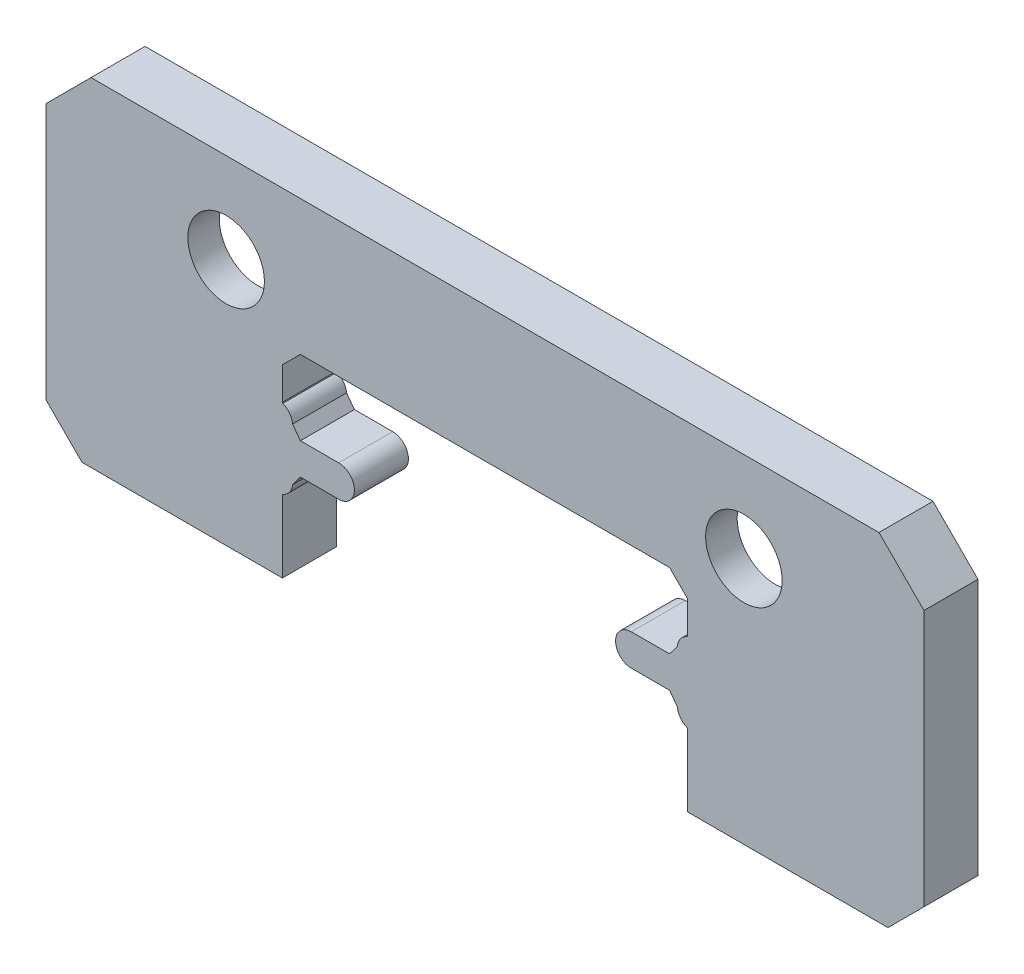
ISO-10303-21;
HEADER;
FILE_DESCRIPTION(('STEP AP214'),'2;1');
FILE_NAME('part.step','',(''),(''),'','','');
FILE_SCHEMA(('AUTOMOTIVE_DESIGN { 1 0 10303 214 1 1 1 1 }'));
ENDSEC;
DATA;
#1=APPLICATION_CONTEXT('core data for automotive mechanical design processes');
#2=APPLICATION_PROTOCOL_DEFINITION('international standard','automotive_design',2000,#1);
#3=PRODUCT_CONTEXT('',#1,'mechanical');
#4=PRODUCT('Part','Part','',(#3));
#5=PRODUCT_RELATED_PRODUCT_CATEGORY('part','',(#4));
#6=PRODUCT_DEFINITION_FORMATION('','',#4);
#7=PRODUCT_DEFINITION_CONTEXT('part definition',#1,'design');
#8=PRODUCT_DEFINITION('design','',#6,#7);
#9=PRODUCT_DEFINITION_SHAPE('','',#8);
#10=(LENGTH_UNIT() NAMED_UNIT(*) SI_UNIT(.MILLI.,.METRE.));
#11=(NAMED_UNIT(*) PLANE_ANGLE_UNIT() SI_UNIT($,.RADIAN.));
#12=(NAMED_UNIT(*) SI_UNIT($,.STERADIAN.) SOLID_ANGLE_UNIT());
#13=UNCERTAINTY_MEASURE_WITH_UNIT(LENGTH_MEASURE(1.E-05),#10,'distance_accuracy_value','');
#14=(GEOMETRIC_REPRESENTATION_CONTEXT(3) GLOBAL_UNCERTAINTY_ASSIGNED_CONTEXT((#13)) GLOBAL_UNIT_ASSIGNED_CONTEXT((#10,
#11,#12)) REPRESENTATION_CONTEXT('',''));
#15=CARTESIAN_POINT('',(0.,0.,0.));
#16=DIRECTION('',(0.,0.,1.));
#17=DIRECTION('',(1.,0.,0.));
#18=AXIS2_PLACEMENT_3D('',#15,#16,#17);
#19=CARTESIAN_POINT('',(9.75,7.5,0.));
#20=DIRECTION('',(0.,0.,1.));
#21=DIRECTION('',(1.,0.,0.));
#22=AXIS2_PLACEMENT_3D('',#19,#20,#21);
#23=PLANE('',#22);
#24=CARTESIAN_POINT('',(5.75,5.5,0.));
#25=DIRECTION('',(0.,0.,-1.));
#26=DIRECTION('',(-1.,0.,0.));
#27=AXIS2_PLACEMENT_3D('',#24,#25,#26);
#28=CIRCLE('',#27,1.7);
#29=CARTESIAN_POINT('',(4.09772883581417,5.1,0.));
#30=VERTEX_POINT('',#29);
#31=CARTESIAN_POINT('',(5.10204481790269,3.92832761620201,0.));
#32=VERTEX_POINT('',#31);
#33=EDGE_CURVE('E427',#30,#32,#28,.T.);
#34=ORIENTED_EDGE('',*,*,#33,.F.);
#35=DIRECTION('',(1.,0.,0.));
#36=VECTOR('',#35,1.);
#37=CARTESIAN_POINT('',(4.34852813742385,5.1,0.));
#38=LINE('',#37,#36);
#39=CARTESIAN_POINT('',(-4.09772883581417,5.09999999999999,0.));
#40=VERTEX_POINT('',#39);
#41=EDGE_CURVE('E452',#40,#30,#38,.T.);
#42=ORIENTED_EDGE('',*,*,#41,.F.);
#43=CARTESIAN_POINT('',(-5.75,5.5,0.));
#44=DIRECTION('',(0.,0.,-1.));
#45=DIRECTION('',(-1.,0.,0.));
#46=AXIS2_PLACEMENT_3D('',#43,#44,#45);
#47=CIRCLE('',#46,1.7);
#48=CARTESIAN_POINT('',(-5.10204481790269,3.92832761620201,0.));
#49=VERTEX_POINT('',#48);
#50=EDGE_CURVE('E945',#49,#40,#47,.T.);
#51=ORIENTED_EDGE('',*,*,#50,.F.);
#52=DIRECTION('',(0.,1.,0.));
#53=VECTOR('',#52,1.);
#54=CARTESIAN_POINT('',(-5.10204481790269,0.,0.));
#55=LINE('',#54,#53);
#56=CARTESIAN_POINT('',(-5.10204481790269,0.,0.));
#57=VERTEX_POINT('',#56);
#58=EDGE_CURVE('E457',#57,#49,#55,.T.);
#59=ORIENTED_EDGE('',*,*,#58,.F.);
#60=DIRECTION('',(1.,0.,0.));
#61=VECTOR('',#60,1.);
#62=CARTESIAN_POINT('',(9.75,0.,0.));
#63=LINE('',#62,#61);
#64=CARTESIAN_POINT('',(-8.95,0.,0.));
#65=VERTEX_POINT('',#64);
#66=EDGE_CURVE('E714',#65,#57,#63,.T.);
#67=ORIENTED_EDGE('',*,*,#66,.F.);
#68=DIRECTION('',(0.707106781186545,-0.70710678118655,0.));
#69=VECTOR('',#68,1.);
#70=CARTESIAN_POINT('',(-8.95,0.,0.));
#71=LINE('',#70,#69);
#72=CARTESIAN_POINT('',(-9.75,0.800000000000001,0.));
#73=VERTEX_POINT('',#72);
#74=EDGE_CURVE('E758',#65,#73,#71,.F.);
#75=ORIENTED_EDGE('',*,*,#74,.T.);
#76=DIRECTION('',(0.,-1.,0.));
#77=VECTOR('',#76,1.);
#78=CARTESIAN_POINT('',(-9.75,0.,0.));
#79=LINE('',#78,#77);
#80=CARTESIAN_POINT('',(-9.75,6.5,0.));
#81=VERTEX_POINT('',#80);
#82=EDGE_CURVE('E729',#81,#73,#79,.T.);
#83=ORIENTED_EDGE('',*,*,#82,.F.);
#84=DIRECTION('',(-0.707106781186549,-0.707106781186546,0.));
#85=VECTOR('',#84,1.);
#86=CARTESIAN_POINT('',(-9.75,6.5,0.));
#87=LINE('',#86,#85);
#88=CARTESIAN_POINT('',(-8.75,7.5,0.));
#89=VERTEX_POINT('',#88);
#90=EDGE_CURVE('E740',#81,#89,#87,.F.);
#91=ORIENTED_EDGE('',*,*,#90,.T.);
#92=DIRECTION('',(-1.,0.,0.));
#93=VECTOR('',#92,1.);
#94=CARTESIAN_POINT('',(9.75,7.5,0.));
#95=LINE('',#94,#93);
#96=CARTESIAN_POINT('',(8.75,7.5,0.));
#97=VERTEX_POINT('',#96);
#98=EDGE_CURVE('E726',#97,#89,#95,.T.);
#99=ORIENTED_EDGE('',*,*,#98,.F.);
#100=DIRECTION('',(-0.707106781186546,0.707106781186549,0.));
#101=VECTOR('',#100,1.);
#102=CARTESIAN_POINT('',(8.75,7.5,0.));
#103=LINE('',#102,#101);
#104=CARTESIAN_POINT('',(9.75,6.49999999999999,0.));
#105=VERTEX_POINT('',#104);
#106=EDGE_CURVE('E742',#97,#105,#103,.F.);
#107=ORIENTED_EDGE('',*,*,#106,.T.);
#108=DIRECTION('',(0.,1.,0.));
#109=VECTOR('',#108,1.);
#110=CARTESIAN_POINT('',(9.75,0.,0.));
#111=LINE('',#110,#109);
#112=CARTESIAN_POINT('',(9.75,0.799999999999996,0.));
#113=VERTEX_POINT('',#112);
#114=EDGE_CURVE('E710',#113,#105,#111,.T.);
#115=ORIENTED_EDGE('',*,*,#114,.F.);
#116=DIRECTION('',(0.707106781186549,0.707106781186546,0.));
#117=VECTOR('',#116,1.);
#118=CARTESIAN_POINT('',(9.75,0.799999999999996,0.));
#119=LINE('',#118,#117);
#120=CARTESIAN_POINT('',(8.95,0.,0.));
#121=VERTEX_POINT('',#120);
#122=EDGE_CURVE('E760',#113,#121,#119,.F.);
#123=ORIENTED_EDGE('',*,*,#122,.T.);
#124=CARTESIAN_POINT('',(5.10204481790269,0.,0.));
#125=VERTEX_POINT('',#124);
#126=EDGE_CURVE('E450',#125,#121,#63,.T.);
#127=ORIENTED_EDGE('',*,*,#126,.F.);
#128=DIRECTION('',(0.,-1.,0.));
#129=VECTOR('',#128,1.);
#130=CARTESIAN_POINT('',(5.10204481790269,0.,0.));
#131=LINE('',#130,#129);
#132=EDGE_CURVE('E443',#32,#125,#131,.T.);
#133=ORIENTED_EDGE('',*,*,#132,.F.);
#134=EDGE_LOOP('',(#34,#42,#51,#59,#67,#75,#83,#91,#99,#107,#115,#123,#127,#133));
#135=FACE_BOUND('',#134,.T.);
#136=ADVANCED_FACE('F17',(#135),#23,.F.);
#137=CARTESIAN_POINT('',(9.75,7.5,1.2));
#138=DIRECTION('',(0.,0.,1.));
#139=DIRECTION('',(1.,0.,0.));
#140=AXIS2_PLACEMENT_3D('',#137,#138,#139);
#141=PLANE('',#140);
#142=CARTESIAN_POINT('',(-5.75,5.5,1.20000000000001));
#143=DIRECTION('',(0.,0.,-1.));
#144=DIRECTION('',(-1.,0.,0.));
#145=AXIS2_PLACEMENT_3D('',#142,#143,#144);
#146=CIRCLE('',#145,0.85);
#147=CARTESIAN_POINT('',(-6.6,5.5,1.20000000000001));
#148=VERTEX_POINT('',#147);
#149=EDGE_CURVE('E1047',#148,#148,#146,.T.);
#150=ORIENTED_EDGE('',*,*,#149,.T.);
#151=EDGE_LOOP('',(#150));
#152=FACE_BOUND('',#151,.T.);
#153=DIRECTION('',(1.,0.,0.));
#154=VECTOR('',#153,1.);
#155=CARTESIAN_POINT('',(9.75,0.,1.2));
#156=LINE('',#155,#154);
#157=CARTESIAN_POINT('',(-8.95000000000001,0.,1.2));
#158=VERTEX_POINT('',#157);
#159=CARTESIAN_POINT('',(-4.50000000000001,0.,1.2));
#160=VERTEX_POINT('',#159);
#161=EDGE_CURVE('E721',#158,#160,#156,.T.);
#162=ORIENTED_EDGE('',*,*,#161,.T.);
#163=DIRECTION('',(0.,1.,0.));
#164=VECTOR('',#163,1.);
#165=CARTESIAN_POINT('',(-4.5,7.5,1.2));
#166=LINE('',#165,#164);
#167=CARTESIAN_POINT('',(-4.5,1.6,1.20000000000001));
#168=VERTEX_POINT('',#167);
#169=EDGE_CURVE('E671',#160,#168,#166,.T.);
#170=ORIENTED_EDGE('',*,*,#169,.T.);
#171=DIRECTION('',(0.595227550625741,0.803557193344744,0.));
#172=VECTOR('',#171,1.);
#173=CARTESIAN_POINT('',(3.37068201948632,12.2254207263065,1.2));
#174=LINE('',#173,#172);
#175=CARTESIAN_POINT('',(-4.48826066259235,1.61584810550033,1.2));
#176=VERTEX_POINT('',#175);
#177=EDGE_CURVE('E677',#168,#176,#174,.T.);
#178=ORIENTED_EDGE('',*,*,#177,.T.);
#179=CARTESIAN_POINT('',(-4.62202164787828,1.93927970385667,1.2));
#180=DIRECTION('',(0.,0.,1.));
#181=DIRECTION('',(1.,0.,0.));
#182=AXIS2_PLACEMENT_3D('',#179,#180,#181);
#183=CIRCLE('',#182,0.35);
#184=CARTESIAN_POINT('',(-4.27364831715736,1.90557477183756,1.2));
#185=VERTEX_POINT('',#184);
#186=EDGE_CURVE('E636',#176,#185,#183,.T.);
#187=ORIENTED_EDGE('',*,*,#186,.T.);
#188=DIRECTION('',(0.595227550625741,0.803557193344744,0.));
#189=VECTOR('',#188,1.);
#190=CARTESIAN_POINT('',(3.37068201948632,12.2254207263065,1.2));
#191=LINE('',#190,#189);
#192=CARTESIAN_POINT('',(-4.1,2.14,1.20000000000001));
#193=VERTEX_POINT('',#192);
#194=EDGE_CURVE('E701',#185,#193,#191,.T.);
#195=ORIENTED_EDGE('',*,*,#194,.T.);
#196=DIRECTION('',(1.,0.,0.));
#197=VECTOR('',#196,1.);
#198=CARTESIAN_POINT('',(9.75000000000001,2.14000000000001,1.2));
#199=LINE('',#198,#197);
#200=CARTESIAN_POINT('',(-3.25,2.14,1.20000000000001));
#201=VERTEX_POINT('',#200);
#202=EDGE_CURVE('E680',#193,#201,#199,.T.);
#203=ORIENTED_EDGE('',*,*,#202,.T.);
#204=CARTESIAN_POINT('',(-3.25,2.49,1.20000000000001));
#205=DIRECTION('',(0.,0.,1.));
#206=DIRECTION('',(1.,0.,0.));
#207=AXIS2_PLACEMENT_3D('',#204,#205,#206);
#208=CIRCLE('',#207,0.35);
#209=CARTESIAN_POINT('',(-3.25,2.84,1.20000000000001));
#210=VERTEX_POINT('',#209);
#211=EDGE_CURVE('E683',#201,#210,#208,.T.);
#212=ORIENTED_EDGE('',*,*,#211,.T.);
#213=DIRECTION('',(-1.,0.,0.));
#214=VECTOR('',#213,1.);
#215=CARTESIAN_POINT('',(9.75000000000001,2.84000000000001,1.2));
#216=LINE('',#215,#214);
#217=CARTESIAN_POINT('',(-4.1,2.83999999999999,1.20000000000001));
#218=VERTEX_POINT('',#217);
#219=EDGE_CURVE('E686',#210,#218,#216,.T.);
#220=ORIENTED_EDGE('',*,*,#219,.T.);
#221=DIRECTION('',(-0.595227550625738,0.803557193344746,0.));
#222=VECTOR('',#221,1.);
#223=CARTESIAN_POINT('',(-1.42187776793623,-0.775465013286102,1.2));
#224=LINE('',#223,#222);
#225=CARTESIAN_POINT('',(-4.27364831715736,3.07442522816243,1.2));
#226=VERTEX_POINT('',#225);
#227=EDGE_CURVE('E689',#218,#226,#224,.T.);
#228=ORIENTED_EDGE('',*,*,#227,.T.);
#229=CARTESIAN_POINT('',(-4.62202164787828,3.04072029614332,1.2));
#230=DIRECTION('',(0.,0.,1.));
#231=DIRECTION('',(1.,0.,0.));
#232=AXIS2_PLACEMENT_3D('',#229,#230,#231);
#233=CIRCLE('',#232,0.35);
#234=CARTESIAN_POINT('',(-4.48826066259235,3.36415189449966,1.2));
#235=VERTEX_POINT('',#234);
#236=EDGE_CURVE('E639',#226,#235,#233,.T.);
#237=ORIENTED_EDGE('',*,*,#236,.T.);
#238=DIRECTION('',(-0.595227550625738,0.803557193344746,0.));
#239=VECTOR('',#238,1.);
#240=CARTESIAN_POINT('',(-1.42187776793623,-0.775465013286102,1.2));
#241=LINE('',#240,#239);
#242=CARTESIAN_POINT('',(-4.5,3.37999999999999,1.20000000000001));
#243=VERTEX_POINT('',#242);
#244=EDGE_CURVE('E698',#235,#243,#241,.T.);
#245=ORIENTED_EDGE('',*,*,#244,.T.);
#246=DIRECTION('',(0.,1.,0.));
#247=VECTOR('',#246,1.);
#248=CARTESIAN_POINT('',(-4.50000000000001,7.49999999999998,1.2));
#249=LINE('',#248,#247);
#250=CARTESIAN_POINT('',(-4.5,4.09999999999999,1.20000000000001));
#251=VERTEX_POINT('',#250);
#252=EDGE_CURVE('E692',#243,#251,#249,.T.);
#253=ORIENTED_EDGE('',*,*,#252,.T.);
#254=DIRECTION('',(0.707106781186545,0.70710678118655,0.));
#255=VECTOR('',#254,1.);
#256=CARTESIAN_POINT('',(4.32499999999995,12.925,1.2));
#257=LINE('',#256,#255);
#258=CARTESIAN_POINT('',(-4.1,4.5,1.20000000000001));
#259=VERTEX_POINT('',#258);
#260=EDGE_CURVE('E695',#251,#259,#257,.T.);
#261=ORIENTED_EDGE('',*,*,#260,.T.);
#262=DIRECTION('',(1.,0.,0.));
#263=VECTOR('',#262,1.);
#264=CARTESIAN_POINT('',(9.75,4.5,1.2));
#265=LINE('',#264,#263);
#266=CARTESIAN_POINT('',(4.1,4.5,1.20000000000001));
#267=VERTEX_POINT('',#266);
#268=EDGE_CURVE('E642',#259,#267,#265,.T.);
#269=ORIENTED_EDGE('',*,*,#268,.T.);
#270=DIRECTION('',(0.707106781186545,-0.70710678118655,0.));
#271=VECTOR('',#270,1.);
#272=CARTESIAN_POINT('',(5.42499999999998,3.175,1.2));
#273=LINE('',#272,#271);
#274=CARTESIAN_POINT('',(4.5,4.1,1.20000000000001));
#275=VERTEX_POINT('',#274);
#276=EDGE_CURVE('E645',#267,#275,#273,.T.);
#277=ORIENTED_EDGE('',*,*,#276,.T.);
#278=DIRECTION('',(0.,-1.,0.));
#279=VECTOR('',#278,1.);
#280=CARTESIAN_POINT('',(4.49999999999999,7.49999999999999,1.2));
#281=LINE('',#280,#279);
#282=CARTESIAN_POINT('',(4.5,3.38,1.20000000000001));
#283=VERTEX_POINT('',#282);
#284=EDGE_CURVE('E648',#275,#283,#281,.T.);
#285=ORIENTED_EDGE('',*,*,#284,.T.);
#286=DIRECTION('',(-0.595227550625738,-0.803557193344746,0.));
#287=VECTOR('',#286,1.);
#288=CARTESIAN_POINT('',(8.33064658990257,8.55137289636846,1.2));
#289=LINE('',#288,#287);
#290=CARTESIAN_POINT('',(4.48826066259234,3.36415189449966,1.2));
#291=VERTEX_POINT('',#290);
#292=EDGE_CURVE('E651',#283,#291,#289,.T.);
#293=ORIENTED_EDGE('',*,*,#292,.T.);
#294=CARTESIAN_POINT('',(4.62202164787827,3.04072029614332,1.2));
#295=DIRECTION('',(0.,0.,1.));
#296=DIRECTION('',(1.,0.,0.));
#297=AXIS2_PLACEMENT_3D('',#294,#295,#296);
#298=CIRCLE('',#297,0.35);
#299=CARTESIAN_POINT('',(4.27364831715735,3.07442522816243,1.2));
#300=VERTEX_POINT('',#299);
#301=EDGE_CURVE('E633',#291,#300,#298,.T.);
#302=ORIENTED_EDGE('',*,*,#301,.T.);
#303=DIRECTION('',(-0.595227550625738,-0.803557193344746,0.));
#304=VECTOR('',#303,1.);
#305=CARTESIAN_POINT('',(8.33064658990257,8.55137289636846,1.2));
#306=LINE('',#305,#304);
#307=CARTESIAN_POINT('',(4.1,2.84,1.20000000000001));
#308=VERTEX_POINT('',#307);
#309=EDGE_CURVE('E704',#300,#308,#306,.T.);
#310=ORIENTED_EDGE('',*,*,#309,.T.);
#311=DIRECTION('',(-1.,0.,0.));
#312=VECTOR('',#311,1.);
#313=CARTESIAN_POINT('',(9.74999999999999,2.83999999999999,1.2));
#314=LINE('',#313,#312);
#315=CARTESIAN_POINT('',(3.25,2.84,1.20000000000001));
#316=VERTEX_POINT('',#315);
#317=EDGE_CURVE('E654',#308,#316,#314,.T.);
#318=ORIENTED_EDGE('',*,*,#317,.T.);
#319=CARTESIAN_POINT('',(3.25,2.49,1.20000000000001));
#320=DIRECTION('',(0.,0.,1.));
#321=DIRECTION('',(1.,0.,0.));
#322=AXIS2_PLACEMENT_3D('',#319,#320,#321);
#323=CIRCLE('',#322,0.35);
#324=CARTESIAN_POINT('',(3.25,2.14,1.20000000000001));
#325=VERTEX_POINT('',#324);
#326=EDGE_CURVE('E657',#316,#325,#323,.T.);
#327=ORIENTED_EDGE('',*,*,#326,.T.);
#328=DIRECTION('',(1.,0.,0.));
#329=VECTOR('',#328,1.);
#330=CARTESIAN_POINT('',(9.74999999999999,2.13999999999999,1.2));
#331=LINE('',#330,#329);
#332=CARTESIAN_POINT('',(4.1,2.14,1.20000000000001));
#333=VERTEX_POINT('',#332);
#334=EDGE_CURVE('E660',#325,#333,#331,.T.);
#335=ORIENTED_EDGE('',*,*,#334,.T.);
#336=DIRECTION('',(0.595227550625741,-0.803557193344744,0.));
#337=VECTOR('',#336,1.);
#338=CARTESIAN_POINT('',(3.53808680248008,2.89858281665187,1.2));
#339=LINE('',#338,#337);
#340=CARTESIAN_POINT('',(4.27364831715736,1.90557477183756,1.2));
#341=VERTEX_POINT('',#340);
#342=EDGE_CURVE('E663',#333,#341,#339,.T.);
#343=ORIENTED_EDGE('',*,*,#342,.T.);
#344=CARTESIAN_POINT('',(4.62202164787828,1.93927970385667,1.2));
#345=DIRECTION('',(0.,0.,1.));
#346=DIRECTION('',(1.,0.,0.));
#347=AXIS2_PLACEMENT_3D('',#344,#345,#346);
#348=CIRCLE('',#347,0.35);
#349=CARTESIAN_POINT('',(4.48826066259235,1.61584810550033,1.2));
#350=VERTEX_POINT('',#349);
#351=EDGE_CURVE('E630',#341,#350,#348,.T.);
#352=ORIENTED_EDGE('',*,*,#351,.T.);
#353=DIRECTION('',(0.595227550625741,-0.803557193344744,0.));
#354=VECTOR('',#353,1.);
#355=CARTESIAN_POINT('',(3.53808680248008,2.89858281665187,1.2));
#356=LINE('',#355,#354);
#357=CARTESIAN_POINT('',(4.5,1.6,1.20000000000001));
#358=VERTEX_POINT('',#357);
#359=EDGE_CURVE('E707',#350,#358,#356,.T.);
#360=ORIENTED_EDGE('',*,*,#359,.T.);
#361=DIRECTION('',(0.,-1.,0.));
#362=VECTOR('',#361,1.);
#363=CARTESIAN_POINT('',(4.5,7.49999999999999,1.2));
#364=LINE('',#363,#362);
#365=CARTESIAN_POINT('',(4.5,0.,1.2));
#366=VERTEX_POINT('',#365);
#367=EDGE_CURVE('E666',#358,#366,#364,.T.);
#368=ORIENTED_EDGE('',*,*,#367,.T.);
#369=CARTESIAN_POINT('',(8.95,0.,1.2));
#370=VERTEX_POINT('',#369);
#371=EDGE_CURVE('E720',#366,#370,#156,.T.);
#372=ORIENTED_EDGE('',*,*,#371,.T.);
#373=DIRECTION('',(-0.707106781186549,-0.707106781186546,0.));
#374=VECTOR('',#373,1.);
#375=CARTESIAN_POINT('',(13.1,4.14999999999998,1.2));
#376=LINE('',#375,#374);
#377=CARTESIAN_POINT('',(9.75,0.799999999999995,1.2));
#378=VERTEX_POINT('',#377);
#379=EDGE_CURVE('E770',#370,#378,#376,.F.);
#380=ORIENTED_EDGE('',*,*,#379,.T.);
#381=DIRECTION('',(0.,1.,0.));
#382=VECTOR('',#381,1.);
#383=CARTESIAN_POINT('',(9.75,0.,1.2));
#384=LINE('',#383,#382);
#385=CARTESIAN_POINT('',(9.75,6.49999999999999,1.2));
#386=VERTEX_POINT('',#385);
#387=EDGE_CURVE('E711',#378,#386,#384,.T.);
#388=ORIENTED_EDGE('',*,*,#387,.T.);
#389=DIRECTION('',(0.707106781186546,-0.707106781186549,0.));
#390=VECTOR('',#389,1.);
#391=CARTESIAN_POINT('',(9.25,7.,1.2));
#392=LINE('',#391,#390);
#393=CARTESIAN_POINT('',(8.75,7.5,1.2));
#394=VERTEX_POINT('',#393);
#395=EDGE_CURVE('E750',#386,#394,#392,.F.);
#396=ORIENTED_EDGE('',*,*,#395,.T.);
#397=DIRECTION('',(-1.,0.,0.));
#398=VECTOR('',#397,1.);
#399=CARTESIAN_POINT('',(9.75,7.5,1.2));
#400=LINE('',#399,#398);
#401=CARTESIAN_POINT('',(-8.74999999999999,7.5,1.2));
#402=VERTEX_POINT('',#401);
#403=EDGE_CURVE('E713',#394,#402,#400,.T.);
#404=ORIENTED_EDGE('',*,*,#403,.T.);
#405=DIRECTION('',(0.707106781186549,0.707106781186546,0.));
#406=VECTOR('',#405,1.);
#407=CARTESIAN_POINT('',(0.500000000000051,16.75,1.2));
#408=LINE('',#407,#406);
#409=CARTESIAN_POINT('',(-9.75,6.5,1.2));
#410=VERTEX_POINT('',#409);
#411=EDGE_CURVE('E748',#402,#410,#408,.F.);
#412=ORIENTED_EDGE('',*,*,#411,.T.);
#413=DIRECTION('',(0.,-1.,0.));
#414=VECTOR('',#413,1.);
#415=CARTESIAN_POINT('',(-9.75,0.,1.2));
#416=LINE('',#415,#414);
#417=CARTESIAN_POINT('',(-9.75,0.799999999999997,1.2));
#418=VERTEX_POINT('',#417);
#419=EDGE_CURVE('E717',#410,#418,#416,.T.);
#420=ORIENTED_EDGE('',*,*,#419,.T.);
#421=DIRECTION('',(-0.707106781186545,0.70710678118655,0.));
#422=VECTOR('',#421,1.);
#423=CARTESIAN_POINT('',(-3.35000000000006,-5.59999999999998,1.2));
#424=LINE('',#423,#422);
#425=EDGE_CURVE('E768',#418,#158,#424,.F.);
#426=ORIENTED_EDGE('',*,*,#425,.T.);
#427=EDGE_LOOP('',(#162,#170,#178,#187,#195,#203,#212,#220,#228,#237,#245,#253,#261,#269,#277,
#285,#293,#302,#310,#318,#327,#335,#343,#352,#360,#368,#372,#380,#388,#396,#404,#412,#420,#426));
#428=FACE_BOUND('',#427,.T.);
#429=CARTESIAN_POINT('',(5.75,5.5,1.20000000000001));
#430=DIRECTION('',(0.,0.,-1.));
#431=DIRECTION('',(-1.,0.,0.));
#432=AXIS2_PLACEMENT_3D('',#429,#430,#431);
#433=CIRCLE('',#432,0.85);
#434=CARTESIAN_POINT('',(4.9,5.5,1.20000000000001));
#435=VERTEX_POINT('',#434);
#436=EDGE_CURVE('E1029',#435,#435,#433,.T.);
#437=ORIENTED_EDGE('',*,*,#436,.T.);
#438=EDGE_LOOP('',(#437));
#439=FACE_BOUND('',#438,.T.);
#440=ADVANCED_FACE('F1004',(#152,#428,#439),#141,.T.);
#441=CARTESIAN_POINT('',(4.62202164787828,1.93927970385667,0.2));
#442=DIRECTION('',(0.,0.,-1.));
#443=DIRECTION('',(-1.,0.,0.));
#444=AXIS2_PLACEMENT_3D('',#441,#442,#443);
#445=PLANE('',#444);
#446=CARTESIAN_POINT('',(5.75,5.5,0.2));
#447=DIRECTION('',(0.,0.,-1.));
#448=DIRECTION('',(-1.,0.,0.));
#449=AXIS2_PLACEMENT_3D('',#446,#447,#448);
#450=CIRCLE('',#449,1.7);
#451=CARTESIAN_POINT('',(5.10204481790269,3.92832761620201,0.2));
#452=VERTEX_POINT('',#451);
#453=CARTESIAN_POINT('',(4.80204481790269,4.08883701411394,0.2));
#454=VERTEX_POINT('',#453);
#455=EDGE_CURVE('E32',#452,#454,#450,.T.);
#456=ORIENTED_EDGE('',*,*,#455,.F.);
#457=DIRECTION('',(0.,-1.,0.));
#458=VECTOR('',#457,1.);
#459=CARTESIAN_POINT('',(5.10204481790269,0.,0.2));
#460=LINE('',#459,#458);
#461=CARTESIAN_POINT('',(5.10204481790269,0.,0.2));
#462=VERTEX_POINT('',#461);
#463=EDGE_CURVE('E445',#452,#462,#460,.T.);
#464=ORIENTED_EDGE('',*,*,#463,.T.);
#465=DIRECTION('',(-1.,0.,0.));
#466=VECTOR('',#465,1.);
#467=CARTESIAN_POINT('',(4.8,0.,0.2));
#468=LINE('',#467,#466);
#469=CARTESIAN_POINT('',(4.8,0.,0.2));
#470=VERTEX_POINT('',#469);
#471=EDGE_CURVE('E513',#462,#470,#468,.T.);
#472=ORIENTED_EDGE('',*,*,#471,.T.);
#473=DIRECTION('',(0.,1.,0.));
#474=VECTOR('',#473,1.);
#475=CARTESIAN_POINT('',(4.8,0.,0.2));
#476=LINE('',#475,#474);
#477=CARTESIAN_POINT('',(4.8,1.80066616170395,0.2));
#478=VERTEX_POINT('',#477);
#479=EDGE_CURVE('E451',#470,#478,#476,.T.);
#480=ORIENTED_EDGE('',*,*,#479,.T.);
#481=DIRECTION('',(-1.,0.,0.));
#482=VECTOR('',#481,1.);
#483=CARTESIAN_POINT('',(4.8,1.80066616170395,0.2));
#484=LINE('',#483,#482);
#485=CARTESIAN_POINT('',(4.56469551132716,1.80066616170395,0.2));
#486=VERTEX_POINT('',#485);
#487=EDGE_CURVE('E455',#478,#486,#484,.T.);
#488=ORIENTED_EDGE('',*,*,#487,.T.);
#489=CARTESIAN_POINT('',(4.62202164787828,1.93927970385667,0.2));
#490=DIRECTION('',(0.,0.,-1.));
#491=DIRECTION('',(-1.,0.,0.));
#492=AXIS2_PLACEMENT_3D('',#489,#490,#491);
#493=CIRCLE('',#492,0.15);
#494=CARTESIAN_POINT('',(4.47511746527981,1.96959737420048,0.2));
#495=VERTEX_POINT('',#494);
#496=EDGE_CURVE('E805',#486,#495,#493,.T.);
#497=ORIENTED_EDGE('',*,*,#496,.T.);
#498=DIRECTION('',(-0.595227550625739,0.803557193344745,0.));
#499=VECTOR('',#498,1.);
#500=CARTESIAN_POINT('',(4.47511746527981,1.96959737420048,0.2));
#501=LINE('',#500,#499);
#502=CARTESIAN_POINT('',(4.20074514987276,2.34,0.2));
#503=VERTEX_POINT('',#502);
#504=EDGE_CURVE('E808',#495,#503,#501,.T.);
#505=ORIENTED_EDGE('',*,*,#504,.T.);
#506=DIRECTION('',(-1.,0.,0.));
#507=VECTOR('',#506,1.);
#508=CARTESIAN_POINT('',(4.20074514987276,2.34,0.2));
#509=LINE('',#508,#507);
#510=CARTESIAN_POINT('',(3.25,2.34,0.2));
#511=VERTEX_POINT('',#510);
#512=EDGE_CURVE('E811',#503,#511,#509,.T.);
#513=ORIENTED_EDGE('',*,*,#512,.T.);
#514=CARTESIAN_POINT('',(3.25,2.49,0.2));
#515=DIRECTION('',(0.,0.,-1.));
#516=DIRECTION('',(-1.,0.,0.));
#517=AXIS2_PLACEMENT_3D('',#514,#515,#516);
#518=CIRCLE('',#517,0.15);
#519=CARTESIAN_POINT('',(3.25,2.64,0.2));
#520=VERTEX_POINT('',#519);
#521=EDGE_CURVE('E814',#511,#520,#518,.T.);
#522=ORIENTED_EDGE('',*,*,#521,.T.);
#523=DIRECTION('',(1.,0.,0.));
#524=VECTOR('',#523,1.);
#525=CARTESIAN_POINT('',(3.25,2.64,0.2));
#526=LINE('',#525,#524);
#527=CARTESIAN_POINT('',(4.20074514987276,2.63999999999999,0.2));
#528=VERTEX_POINT('',#527);
#529=EDGE_CURVE('E817',#520,#528,#526,.T.);
#530=ORIENTED_EDGE('',*,*,#529,.T.);
#531=DIRECTION('',(0.595227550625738,0.803557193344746,0.));
#532=VECTOR('',#531,1.);
#533=CARTESIAN_POINT('',(4.20074514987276,2.63999999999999,0.2));
#534=LINE('',#533,#532);
#535=CARTESIAN_POINT('',(4.47511746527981,3.01040262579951,0.2));
#536=VERTEX_POINT('',#535);
#537=EDGE_CURVE('E820',#528,#536,#534,.T.);
#538=ORIENTED_EDGE('',*,*,#537,.T.);
#539=CARTESIAN_POINT('',(4.62202164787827,3.04072029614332,0.2));
#540=DIRECTION('',(0.,0.,-1.));
#541=DIRECTION('',(-1.,0.,0.));
#542=AXIS2_PLACEMENT_3D('',#539,#540,#541);
#543=CIRCLE('',#542,0.15);
#544=CARTESIAN_POINT('',(4.56469551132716,3.17933383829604,0.2));
#545=VERTEX_POINT('',#544);
#546=EDGE_CURVE('E823',#536,#545,#543,.T.);
#547=ORIENTED_EDGE('',*,*,#546,.T.);
#548=DIRECTION('',(0.59522755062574,0.803557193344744,0.));
#549=VECTOR('',#548,1.);
#550=CARTESIAN_POINT('',(4.56469551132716,3.17933383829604,0.2));
#551=LINE('',#550,#549);
#552=CARTESIAN_POINT('',(4.80204481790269,3.499755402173,0.2));
#553=VERTEX_POINT('',#552);
#554=EDGE_CURVE('E826',#545,#553,#551,.T.);
#555=ORIENTED_EDGE('',*,*,#554,.T.);
#556=DIRECTION('',(0.,1.,0.));
#557=VECTOR('',#556,1.);
#558=CARTESIAN_POINT('',(4.80204481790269,3.499755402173,0.2));
#559=LINE('',#558,#557);
#560=EDGE_CURVE('E829',#553,#454,#559,.T.);
#561=ORIENTED_EDGE('',*,*,#560,.T.);
#562=EDGE_LOOP('',(#456,#464,#472,#480,#488,#497,#505,#513,#522,#530,#538,#547,#555,#561));
#563=FACE_BOUND('',#562,.T.);
#564=ADVANCED_FACE('F1027',(#563),#445,.T.);
#565=CARTESIAN_POINT('',(4.80204481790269,4.08883701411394,0.));
#566=VERTEX_POINT('',#565);
#567=CARTESIAN_POINT('',(4.20080666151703,4.8,0.));
#568=VERTEX_POINT('',#567);
#569=EDGE_CURVE('E437',#566,#568,#28,.T.);
#570=ORIENTED_EDGE('',*,*,#569,.F.);
#571=DIRECTION('',(0.,1.,0.));
#572=VECTOR('',#571,1.);
#573=CARTESIAN_POINT('',(4.80204481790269,3.499755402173,0.));
#574=LINE('',#573,#572);
#575=CARTESIAN_POINT('',(4.80204481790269,3.499755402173,0.));
#576=VERTEX_POINT('',#575);
#577=EDGE_CURVE('E904',#576,#566,#574,.T.);
#578=ORIENTED_EDGE('',*,*,#577,.F.);
#579=DIRECTION('',(0.59522755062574,0.803557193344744,0.));
#580=VECTOR('',#579,1.);
#581=CARTESIAN_POINT('',(4.56469551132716,3.17933383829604,0.));
#582=LINE('',#581,#580);
#583=CARTESIAN_POINT('',(4.56469551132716,3.17933383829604,0.));
#584=VERTEX_POINT('',#583);
#585=EDGE_CURVE('E901',#584,#576,#582,.T.);
#586=ORIENTED_EDGE('',*,*,#585,.F.);
#587=CARTESIAN_POINT('',(4.62202164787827,3.04072029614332,0.));
#588=DIRECTION('',(0.,0.,-1.));
#589=DIRECTION('',(-1.,0.,0.));
#590=AXIS2_PLACEMENT_3D('',#587,#588,#589);
#591=CIRCLE('',#590,0.15);
#592=CARTESIAN_POINT('',(4.47511746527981,3.01040262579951,0.));
#593=VERTEX_POINT('',#592);
#594=EDGE_CURVE('E898',#593,#584,#591,.T.);
#595=ORIENTED_EDGE('',*,*,#594,.F.);
#596=DIRECTION('',(0.595227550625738,0.803557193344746,0.));
#597=VECTOR('',#596,1.);
#598=CARTESIAN_POINT('',(4.20074514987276,2.63999999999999,0.));
#599=LINE('',#598,#597);
#600=CARTESIAN_POINT('',(4.20074514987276,2.63999999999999,0.));
#601=VERTEX_POINT('',#600);
#602=EDGE_CURVE('E895',#601,#593,#599,.T.);
#603=ORIENTED_EDGE('',*,*,#602,.F.);
#604=DIRECTION('',(1.,0.,0.));
#605=VECTOR('',#604,1.);
#606=CARTESIAN_POINT('',(3.25,2.64,0.));
#607=LINE('',#606,#605);
#608=CARTESIAN_POINT('',(3.25,2.64,0.));
#609=VERTEX_POINT('',#608);
#610=EDGE_CURVE('E892',#609,#601,#607,.T.);
#611=ORIENTED_EDGE('',*,*,#610,.F.);
#612=CARTESIAN_POINT('',(3.25,2.49,0.));
#613=DIRECTION('',(0.,0.,-1.));
#614=DIRECTION('',(-1.,0.,0.));
#615=AXIS2_PLACEMENT_3D('',#612,#613,#614);
#616=CIRCLE('',#615,0.15);
#617=CARTESIAN_POINT('',(3.25,2.34,0.));
#618=VERTEX_POINT('',#617);
#619=EDGE_CURVE('E889',#618,#609,#616,.T.);
#620=ORIENTED_EDGE('',*,*,#619,.F.);
#621=DIRECTION('',(-1.,0.,0.));
#622=VECTOR('',#621,1.);
#623=CARTESIAN_POINT('',(4.20074514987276,2.34,0.));
#624=LINE('',#623,#622);
#625=CARTESIAN_POINT('',(4.20074514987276,2.34,0.));
#626=VERTEX_POINT('',#625);
#627=EDGE_CURVE('E886',#626,#618,#624,.T.);
#628=ORIENTED_EDGE('',*,*,#627,.F.);
#629=DIRECTION('',(-0.595227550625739,0.803557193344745,0.));
#630=VECTOR('',#629,1.);
#631=CARTESIAN_POINT('',(4.47511746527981,1.96959737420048,0.));
#632=LINE('',#631,#630);
#633=CARTESIAN_POINT('',(4.47511746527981,1.96959737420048,0.));
#634=VERTEX_POINT('',#633);
#635=EDGE_CURVE('E883',#634,#626,#632,.T.);
#636=ORIENTED_EDGE('',*,*,#635,.F.);
#637=CARTESIAN_POINT('',(4.62202164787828,1.93927970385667,0.));
#638=DIRECTION('',(0.,0.,-1.));
#639=DIRECTION('',(-1.,0.,0.));
#640=AXIS2_PLACEMENT_3D('',#637,#638,#639);
#641=CIRCLE('',#640,0.15);
#642=CARTESIAN_POINT('',(4.56469551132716,1.80066616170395,0.));
#643=VERTEX_POINT('',#642);
#644=EDGE_CURVE('E880',#643,#634,#641,.T.);
#645=ORIENTED_EDGE('',*,*,#644,.F.);
#646=DIRECTION('',(-1.,0.,0.));
#647=VECTOR('',#646,1.);
#648=CARTESIAN_POINT('',(4.8,1.80066616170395,0.));
#649=LINE('',#648,#647);
#650=CARTESIAN_POINT('',(4.8,1.80066616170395,0.));
#651=VERTEX_POINT('',#650);
#652=EDGE_CURVE('E877',#651,#643,#649,.T.);
#653=ORIENTED_EDGE('',*,*,#652,.F.);
#654=DIRECTION('',(0.,1.,0.));
#655=VECTOR('',#654,1.);
#656=CARTESIAN_POINT('',(4.8,0.,0.));
#657=LINE('',#656,#655);
#658=CARTESIAN_POINT('',(4.8,0.,0.));
#659=VERTEX_POINT('',#658);
#660=EDGE_CURVE('E798',#659,#651,#657,.T.);
#661=ORIENTED_EDGE('',*,*,#660,.F.);
#662=CARTESIAN_POINT('',(4.5,0.,0.));
#663=VERTEX_POINT('',#662);
#664=EDGE_CURVE('E735',#663,#659,#63,.T.);
#665=ORIENTED_EDGE('',*,*,#664,.F.);
#666=DIRECTION('',(0.,-1.,0.));
#667=VECTOR('',#666,1.);
#668=CARTESIAN_POINT('',(4.5,7.49999999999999,0.));
#669=LINE('',#668,#667);
#670=CARTESIAN_POINT('',(4.5,1.6,0.));
#671=VERTEX_POINT('',#670);
#672=EDGE_CURVE('E774',#671,#663,#669,.T.);
#673=ORIENTED_EDGE('',*,*,#672,.F.);
#674=DIRECTION('',(-0.595227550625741,0.803557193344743,0.));
#675=VECTOR('',#674,1.);
#676=CARTESIAN_POINT('',(4.5,1.6,0.));
#677=LINE('',#676,#675);
#678=CARTESIAN_POINT('',(4.48826066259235,1.61584810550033,0.));
#679=VERTEX_POINT('',#678);
#680=EDGE_CURVE('E573',#671,#679,#677,.T.);
#681=ORIENTED_EDGE('',*,*,#680,.T.);
#682=CARTESIAN_POINT('',(4.62202164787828,1.93927970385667,0.));
#683=DIRECTION('',(0.,0.,1.));
#684=DIRECTION('',(-1.,0.,0.));
#685=AXIS2_PLACEMENT_3D('',#682,#683,#684);
#686=CIRCLE('',#685,0.35);
#687=CARTESIAN_POINT('',(4.27364831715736,1.90557477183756,0.));
#688=VERTEX_POINT('',#687);
#689=EDGE_CURVE('E463',#688,#679,#686,.T.);
#690=ORIENTED_EDGE('',*,*,#689,.F.);
#691=CARTESIAN_POINT('',(4.1,2.14,0.));
#692=VERTEX_POINT('',#691);
#693=EDGE_CURVE('E572',#688,#692,#677,.T.);
#694=ORIENTED_EDGE('',*,*,#693,.T.);
#695=DIRECTION('',(-1.,0.,0.));
#696=VECTOR('',#695,1.);
#697=CARTESIAN_POINT('',(3.25,2.14,0.));
#698=LINE('',#697,#696);
#699=CARTESIAN_POINT('',(3.25,2.14,0.));
#700=VERTEX_POINT('',#699);
#701=EDGE_CURVE('E576',#692,#700,#698,.T.);
#702=ORIENTED_EDGE('',*,*,#701,.T.);
#703=CARTESIAN_POINT('',(3.25,2.49,0.));
#704=DIRECTION('',(0.,0.,-1.));
#705=DIRECTION('',(1.,0.,0.));
#706=AXIS2_PLACEMENT_3D('',#703,#704,#705);
#707=CIRCLE('',#706,0.35);
#708=CARTESIAN_POINT('',(3.25,2.84,0.));
#709=VERTEX_POINT('',#708);
#710=EDGE_CURVE('E579',#700,#709,#707,.T.);
#711=ORIENTED_EDGE('',*,*,#710,.T.);
#712=DIRECTION('',(1.,0.,0.));
#713=VECTOR('',#712,1.);
#714=CARTESIAN_POINT('',(3.25,2.84,0.));
#715=LINE('',#714,#713);
#716=CARTESIAN_POINT('',(4.1,2.84,0.));
#717=VERTEX_POINT('',#716);
#718=EDGE_CURVE('E582',#709,#717,#715,.T.);
#719=ORIENTED_EDGE('',*,*,#718,.T.);
#720=DIRECTION('',(0.595227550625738,0.803557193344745,0.));
#721=VECTOR('',#720,1.);
#722=CARTESIAN_POINT('',(4.1,2.84,0.));
#723=LINE('',#722,#721);
#724=CARTESIAN_POINT('',(4.27364831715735,3.07442522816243,0.));
#725=VERTEX_POINT('',#724);
#726=EDGE_CURVE('E586',#717,#725,#723,.T.);
#727=ORIENTED_EDGE('',*,*,#726,.T.);
#728=CARTESIAN_POINT('',(4.62202164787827,3.04072029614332,0.));
#729=DIRECTION('',(0.,0.,1.));
#730=DIRECTION('',(-1.,0.,0.));
#731=AXIS2_PLACEMENT_3D('',#728,#729,#730);
#732=CIRCLE('',#731,0.35);
#733=CARTESIAN_POINT('',(4.48826066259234,3.36415189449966,0.));
#734=VERTEX_POINT('',#733);
#735=EDGE_CURVE('E522',#734,#725,#732,.T.);
#736=ORIENTED_EDGE('',*,*,#735,.F.);
#737=CARTESIAN_POINT('',(4.5,3.38,0.));
#738=VERTEX_POINT('',#737);
#739=EDGE_CURVE('E585',#734,#738,#723,.T.);
#740=ORIENTED_EDGE('',*,*,#739,.T.);
#741=DIRECTION('',(0.,1.,0.));
#742=VECTOR('',#741,1.);
#743=CARTESIAN_POINT('',(4.5,3.38,0.));
#744=LINE('',#743,#742);
#745=CARTESIAN_POINT('',(4.5,4.1,0.));
#746=VERTEX_POINT('',#745);
#747=EDGE_CURVE('E589',#738,#746,#744,.T.);
#748=ORIENTED_EDGE('',*,*,#747,.T.);
#749=DIRECTION('',(-0.707106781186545,0.70710678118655,0.));
#750=VECTOR('',#749,1.);
#751=CARTESIAN_POINT('',(4.5,4.1,0.));
#752=LINE('',#751,#750);
#753=CARTESIAN_POINT('',(4.1,4.5,0.));
#754=VERTEX_POINT('',#753);
#755=EDGE_CURVE('E592',#746,#754,#752,.T.);
#756=ORIENTED_EDGE('',*,*,#755,.T.);
#757=DIRECTION('',(-1.,0.,0.));
#758=VECTOR('',#757,1.);
#759=CARTESIAN_POINT('',(-4.1,4.5,0.));
#760=LINE('',#759,#758);
#761=CARTESIAN_POINT('',(-4.1,4.5,0.));
#762=VERTEX_POINT('',#761);
#763=EDGE_CURVE('E595',#754,#762,#760,.T.);
#764=ORIENTED_EDGE('',*,*,#763,.T.);
#765=DIRECTION('',(-0.707106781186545,-0.70710678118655,0.));
#766=VECTOR('',#765,1.);
#767=CARTESIAN_POINT('',(-4.5,4.09999999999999,0.));
#768=LINE('',#767,#766);
#769=CARTESIAN_POINT('',(-4.5,4.09999999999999,0.));
#770=VERTEX_POINT('',#769);
#771=EDGE_CURVE('E546',#762,#770,#768,.T.);
#772=ORIENTED_EDGE('',*,*,#771,.T.);
#773=DIRECTION('',(0.,-1.,0.));
#774=VECTOR('',#773,1.);
#775=CARTESIAN_POINT('',(-4.5,3.37999999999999,0.));
#776=LINE('',#775,#774);
#777=CARTESIAN_POINT('',(-4.5,3.37999999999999,0.));
#778=VERTEX_POINT('',#777);
#779=EDGE_CURVE('E549',#770,#778,#776,.T.);
#780=ORIENTED_EDGE('',*,*,#779,.T.);
#781=DIRECTION('',(0.595227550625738,-0.803557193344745,0.));
#782=VECTOR('',#781,1.);
#783=CARTESIAN_POINT('',(-4.1,2.83999999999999,0.));
#784=LINE('',#783,#782);
#785=CARTESIAN_POINT('',(-4.48826066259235,3.36415189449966,0.));
#786=VERTEX_POINT('',#785);
#787=EDGE_CURVE('E553',#778,#786,#784,.T.);
#788=ORIENTED_EDGE('',*,*,#787,.T.);
#789=CARTESIAN_POINT('',(-4.62202164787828,3.04072029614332,0.));
#790=DIRECTION('',(0.,0.,1.));
#791=DIRECTION('',(1.,0.,0.));
#792=AXIS2_PLACEMENT_3D('',#789,#790,#791);
#793=CIRCLE('',#792,0.35);
#794=CARTESIAN_POINT('',(-4.27364831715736,3.07442522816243,0.));
#795=VERTEX_POINT('',#794);
#796=EDGE_CURVE('E538',#795,#786,#793,.T.);
#797=ORIENTED_EDGE('',*,*,#796,.F.);
#798=CARTESIAN_POINT('',(-4.1,2.83999999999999,0.));
#799=VERTEX_POINT('',#798);
#800=EDGE_CURVE('E552',#795,#799,#784,.T.);
#801=ORIENTED_EDGE('',*,*,#800,.T.);
#802=DIRECTION('',(1.,0.,0.));
#803=VECTOR('',#802,1.);
#804=CARTESIAN_POINT('',(-3.25,2.84,0.));
#805=LINE('',#804,#803);
#806=CARTESIAN_POINT('',(-3.25,2.84,0.));
#807=VERTEX_POINT('',#806);
#808=EDGE_CURVE('E556',#799,#807,#805,.T.);
#809=ORIENTED_EDGE('',*,*,#808,.T.);
#810=CARTESIAN_POINT('',(-3.25,2.49,0.));
#811=DIRECTION('',(0.,0.,-1.));
#812=DIRECTION('',(-1.,0.,0.));
#813=AXIS2_PLACEMENT_3D('',#810,#811,#812);
#814=CIRCLE('',#813,0.35);
#815=CARTESIAN_POINT('',(-3.25,2.14,0.));
#816=VERTEX_POINT('',#815);
#817=EDGE_CURVE('E559',#807,#816,#814,.T.);
#818=ORIENTED_EDGE('',*,*,#817,.T.);
#819=DIRECTION('',(-1.,0.,0.));
#820=VECTOR('',#819,1.);
#821=CARTESIAN_POINT('',(-3.25,2.14,0.));
#822=LINE('',#821,#820);
#823=CARTESIAN_POINT('',(-4.1,2.14,0.));
#824=VERTEX_POINT('',#823);
#825=EDGE_CURVE('E562',#816,#824,#822,.T.);
#826=ORIENTED_EDGE('',*,*,#825,.T.);
#827=DIRECTION('',(-0.59522755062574,-0.803557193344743,0.));
#828=VECTOR('',#827,1.);
#829=CARTESIAN_POINT('',(-4.5,1.6,0.));
#830=LINE('',#829,#828);
#831=CARTESIAN_POINT('',(-4.27364831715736,1.90557477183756,0.));
#832=VERTEX_POINT('',#831);
#833=EDGE_CURVE('E566',#824,#832,#830,.T.);
#834=ORIENTED_EDGE('',*,*,#833,.T.);
#835=CARTESIAN_POINT('',(-4.62202164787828,1.93927970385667,0.));
#836=DIRECTION('',(0.,0.,1.));
#837=DIRECTION('',(1.,0.,0.));
#838=AXIS2_PLACEMENT_3D('',#835,#836,#837);
#839=CIRCLE('',#838,0.35);
#840=CARTESIAN_POINT('',(-4.48826066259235,1.61584810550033,0.));
#841=VERTEX_POINT('',#840);
#842=EDGE_CURVE('E530',#841,#832,#839,.T.);
#843=ORIENTED_EDGE('',*,*,#842,.F.);
#844=CARTESIAN_POINT('',(-4.5,1.6,0.));
#845=VERTEX_POINT('',#844);
#846=EDGE_CURVE('E565',#841,#845,#830,.T.);
#847=ORIENTED_EDGE('',*,*,#846,.T.);
#848=DIRECTION('',(0.,-1.,0.));
#849=VECTOR('',#848,1.);
#850=CARTESIAN_POINT('',(-4.5,1.6,0.));
#851=LINE('',#850,#849);
#852=CARTESIAN_POINT('',(-4.5,0.,0.));
#853=VERTEX_POINT('',#852);
#854=EDGE_CURVE('E569',#845,#853,#851,.T.);
#855=ORIENTED_EDGE('',*,*,#854,.T.);
#856=CARTESIAN_POINT('',(-4.8,0.,0.));
#857=VERTEX_POINT('',#856);
#858=EDGE_CURVE('E734',#857,#853,#63,.T.);
#859=ORIENTED_EDGE('',*,*,#858,.F.);
#860=DIRECTION('',(0.,-1.,0.));
#861=VECTOR('',#860,1.);
#862=CARTESIAN_POINT('',(-4.8,0.,0.));
#863=LINE('',#862,#861);
#864=CARTESIAN_POINT('',(-4.8,1.80066616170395,0.));
#865=VERTEX_POINT('',#864);
#866=EDGE_CURVE('E937',#865,#857,#863,.T.);
#867=ORIENTED_EDGE('',*,*,#866,.F.);
#868=DIRECTION('',(-1.,0.,0.));
#869=VECTOR('',#868,1.);
#870=CARTESIAN_POINT('',(-4.8,1.80066616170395,0.));
#871=LINE('',#870,#869);
#872=CARTESIAN_POINT('',(-4.56469551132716,1.80066616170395,0.));
#873=VERTEX_POINT('',#872);
#874=EDGE_CURVE('E934',#873,#865,#871,.T.);
#875=ORIENTED_EDGE('',*,*,#874,.F.);
#876=CARTESIAN_POINT('',(-4.62202164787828,1.93927970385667,0.));
#877=DIRECTION('',(0.,0.,-1.));
#878=DIRECTION('',(1.,0.,0.));
#879=AXIS2_PLACEMENT_3D('',#876,#877,#878);
#880=CIRCLE('',#879,0.15);
#881=CARTESIAN_POINT('',(-4.47511746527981,1.96959737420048,0.));
#882=VERTEX_POINT('',#881);
#883=EDGE_CURVE('E931',#882,#873,#880,.T.);
#884=ORIENTED_EDGE('',*,*,#883,.F.);
#885=DIRECTION('',(-0.595227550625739,-0.803557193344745,0.));
#886=VECTOR('',#885,1.);
#887=CARTESIAN_POINT('',(-4.47511746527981,1.96959737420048,0.));
#888=LINE('',#887,#886);
#889=CARTESIAN_POINT('',(-4.20074514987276,2.34,0.));
#890=VERTEX_POINT('',#889);
#891=EDGE_CURVE('E928',#890,#882,#888,.T.);
#892=ORIENTED_EDGE('',*,*,#891,.F.);
#893=DIRECTION('',(-1.,0.,0.));
#894=VECTOR('',#893,1.);
#895=CARTESIAN_POINT('',(-4.20074514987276,2.34,0.));
#896=LINE('',#895,#894);
#897=CARTESIAN_POINT('',(-3.25,2.34,0.));
#898=VERTEX_POINT('',#897);
#899=EDGE_CURVE('E925',#898,#890,#896,.T.);
#900=ORIENTED_EDGE('',*,*,#899,.F.);
#901=CARTESIAN_POINT('',(-3.25,2.49,0.));
#902=DIRECTION('',(0.,0.,-1.));
#903=DIRECTION('',(1.,0.,0.));
#904=AXIS2_PLACEMENT_3D('',#901,#902,#903);
#905=CIRCLE('',#904,0.15);
#906=CARTESIAN_POINT('',(-3.25,2.64,0.));
#907=VERTEX_POINT('',#906);
#908=EDGE_CURVE('E922',#907,#898,#905,.T.);
#909=ORIENTED_EDGE('',*,*,#908,.F.);
#910=DIRECTION('',(1.,0.,0.));
#911=VECTOR('',#910,1.);
#912=CARTESIAN_POINT('',(-3.25,2.64,0.));
#913=LINE('',#912,#911);
#914=CARTESIAN_POINT('',(-4.20074514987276,2.63999999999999,0.));
#915=VERTEX_POINT('',#914);
#916=EDGE_CURVE('E919',#915,#907,#913,.T.);
#917=ORIENTED_EDGE('',*,*,#916,.F.);
#918=DIRECTION('',(0.595227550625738,-0.803557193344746,0.));
#919=VECTOR('',#918,1.);
#920=CARTESIAN_POINT('',(-4.20074514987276,2.63999999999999,0.));
#921=LINE('',#920,#919);
#922=CARTESIAN_POINT('',(-4.47511746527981,3.01040262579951,0.));
#923=VERTEX_POINT('',#922);
#924=EDGE_CURVE('E916',#923,#915,#921,.T.);
#925=ORIENTED_EDGE('',*,*,#924,.F.);
#926=CARTESIAN_POINT('',(-4.62202164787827,3.04072029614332,0.));
#927=DIRECTION('',(0.,0.,-1.));
#928=DIRECTION('',(1.,0.,0.));
#929=AXIS2_PLACEMENT_3D('',#926,#927,#928);
#930=CIRCLE('',#929,0.15);
#931=CARTESIAN_POINT('',(-4.56469551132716,3.17933383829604,0.));
#932=VERTEX_POINT('',#931);
#933=EDGE_CURVE('E913',#932,#923,#930,.T.);
#934=ORIENTED_EDGE('',*,*,#933,.F.);
#935=DIRECTION('',(0.59522755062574,-0.803557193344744,0.));
#936=VECTOR('',#935,1.);
#937=CARTESIAN_POINT('',(-4.56469551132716,3.17933383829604,0.));
#938=LINE('',#937,#936);
#939=CARTESIAN_POINT('',(-4.80204481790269,3.499755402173,0.));
#940=VERTEX_POINT('',#939);
#941=EDGE_CURVE('E910',#940,#932,#938,.T.);
#942=ORIENTED_EDGE('',*,*,#941,.F.);
#943=DIRECTION('',(0.,-1.,0.));
#944=VECTOR('',#943,1.);
#945=CARTESIAN_POINT('',(-4.80204481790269,3.499755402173,0.));
#946=LINE('',#945,#944);
#947=CARTESIAN_POINT('',(-4.80204481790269,4.08883701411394,0.));
#948=VERTEX_POINT('',#947);
#949=EDGE_CURVE('E908',#948,#940,#946,.T.);
#950=ORIENTED_EDGE('',*,*,#949,.F.);
#951=CARTESIAN_POINT('',(-4.20080666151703,4.79999999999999,0.));
#952=VERTEX_POINT('',#951);
#953=EDGE_CURVE('E1040',#952,#948,#47,.T.);
#954=ORIENTED_EDGE('',*,*,#953,.F.);
#955=DIRECTION('',(-1.,0.,0.));
#956=VECTOR('',#955,1.);
#957=CARTESIAN_POINT('',(4.22426406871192,4.8,0.));
#958=LINE('',#957,#956);
#959=EDGE_CURVE('E795',#568,#952,#958,.T.);
#960=ORIENTED_EDGE('',*,*,#959,.F.);
#961=EDGE_LOOP('',(#570,#578,#586,#595,#603,#611,#620,#628,#636,#645,#653,#661,#665,#673,#681,
#690,#694,#702,#711,#719,#727,#736,#740,#748,#756,#764,#772,#780,#788,#797,#801,#809,#818,#826,
#834,#843,#847,#855,#859,#867,#875,#884,#892,#900,#909,#917,#925,#934,#942,#950,#954,#960));
#962=FACE_BOUND('',#961,.T.);
#963=ADVANCED_FACE('F997',(#962),#23,.F.);
#964=CARTESIAN_POINT('',(4.20080666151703,4.8,0.2));
#965=VERTEX_POINT('',#964);
#966=CARTESIAN_POINT('',(4.09772883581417,5.1,0.2));
#967=VERTEX_POINT('',#966);
#968=EDGE_CURVE('E1031',#965,#967,#450,.T.);
#969=ORIENTED_EDGE('',*,*,#968,.F.);
#970=DIRECTION('',(-1.,0.,0.));
#971=VECTOR('',#970,1.);
#972=CARTESIAN_POINT('',(4.22426406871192,4.8,0.2));
#973=LINE('',#972,#971);
#974=CARTESIAN_POINT('',(-4.20080666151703,4.79999999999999,0.2));
#975=VERTEX_POINT('',#974);
#976=EDGE_CURVE('E793',#965,#975,#973,.T.);
#977=ORIENTED_EDGE('',*,*,#976,.T.);
#978=CARTESIAN_POINT('',(-5.75,5.5,0.2));
#979=DIRECTION('',(0.,0.,-1.));
#980=DIRECTION('',(-1.,0.,0.));
#981=AXIS2_PLACEMENT_3D('',#978,#979,#980);
#982=CIRCLE('',#981,1.7);
#983=CARTESIAN_POINT('',(-4.09772883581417,5.09999999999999,0.2));
#984=VERTEX_POINT('',#983);
#985=EDGE_CURVE('E25',#984,#975,#982,.T.);
#986=ORIENTED_EDGE('',*,*,#985,.F.);
#987=DIRECTION('',(1.,0.,0.));
#988=VECTOR('',#987,1.);
#989=CARTESIAN_POINT('',(4.34852813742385,5.1,0.2));
#990=LINE('',#989,#988);
#991=EDGE_CURVE('E871',#984,#967,#990,.T.);
#992=ORIENTED_EDGE('',*,*,#991,.T.);
#993=EDGE_LOOP('',(#969,#977,#986,#992));
#994=FACE_BOUND('',#993,.T.);
#995=ADVANCED_FACE('F1113',(#994),#445,.T.);
#996=CARTESIAN_POINT('',(9.75,0.,1.2));
#997=DIRECTION('',(0.,1.,0.));
#998=DIRECTION('',(0.,0.,1.));
#999=AXIS2_PLACEMENT_3D('',#996,#997,#998);
#1000=PLANE('',#999);
#1001=ORIENTED_EDGE('',*,*,#66,.T.);
#1002=DIRECTION('',(0.,0.,-1.));
#1003=VECTOR('',#1002,1.);
#1004=CARTESIAN_POINT('',(-5.10204481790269,0.,0.2));
#1005=LINE('',#1004,#1003);
#1006=CARTESIAN_POINT('',(-5.10204481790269,0.,0.2));
#1007=VERTEX_POINT('',#1006);
#1008=EDGE_CURVE('E466',#1007,#57,#1005,.T.);
#1009=ORIENTED_EDGE('',*,*,#1008,.F.);
#1010=DIRECTION('',(-1.,0.,0.));
#1011=VECTOR('',#1010,1.);
#1012=CARTESIAN_POINT('',(-4.8,0.,0.2));
#1013=LINE('',#1012,#1011);
#1014=CARTESIAN_POINT('',(-4.8,0.,0.2));
#1015=VERTEX_POINT('',#1014);
#1016=EDGE_CURVE('E865',#1015,#1007,#1013,.T.);
#1017=ORIENTED_EDGE('',*,*,#1016,.F.);
#1018=DIRECTION('',(0.,0.,-1.));
#1019=VECTOR('',#1018,1.);
#1020=CARTESIAN_POINT('',(-4.8,0.,0.2));
#1021=LINE('',#1020,#1019);
#1022=EDGE_CURVE('E468',#1015,#857,#1021,.T.);
#1023=ORIENTED_EDGE('',*,*,#1022,.T.);
#1024=ORIENTED_EDGE('',*,*,#858,.T.);
#1025=DIRECTION('',(0.,0.,-1.));
#1026=VECTOR('',#1025,1.);
#1027=CARTESIAN_POINT('',(-4.50000000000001,0.,1.2));
#1028=LINE('',#1027,#1026);
#1029=EDGE_CURVE('E674',#160,#853,#1028,.T.);
#1030=ORIENTED_EDGE('',*,*,#1029,.F.);
#1031=ORIENTED_EDGE('',*,*,#161,.F.);
#1032=DIRECTION('',(0.,0.,-1.));
#1033=VECTOR('',#1032,1.);
#1034=CARTESIAN_POINT('',(-8.95,0.,1.2));
#1035=LINE('',#1034,#1033);
#1036=EDGE_CURVE('E762',#158,#65,#1035,.T.);
#1037=ORIENTED_EDGE('',*,*,#1036,.T.);
#1038=EDGE_LOOP('',(#1001,#1009,#1017,#1023,#1024,#1030,#1031,#1037));
#1039=FACE_BOUND('',#1038,.T.);
#1040=ADVANCED_FACE('F947',(#1039),#1000,.F.);
#1041=ORIENTED_EDGE('',*,*,#664,.T.);
#1042=DIRECTION('',(0.,0.,-1.));
#1043=VECTOR('',#1042,1.);
#1044=CARTESIAN_POINT('',(4.8,0.,0.2));
#1045=LINE('',#1044,#1043);
#1046=EDGE_CURVE('E461',#470,#659,#1045,.T.);
#1047=ORIENTED_EDGE('',*,*,#1046,.F.);
#1048=ORIENTED_EDGE('',*,*,#471,.F.);
#1049=DIRECTION('',(0.,0.,-1.));
#1050=VECTOR('',#1049,1.);
#1051=CARTESIAN_POINT('',(5.10204481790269,0.,0.2));
#1052=LINE('',#1051,#1050);
#1053=EDGE_CURVE('E464',#462,#125,#1052,.T.);
#1054=ORIENTED_EDGE('',*,*,#1053,.T.);
#1055=ORIENTED_EDGE('',*,*,#126,.T.);
#1056=DIRECTION('',(0.,0.,1.));
#1057=VECTOR('',#1056,1.);
#1058=CARTESIAN_POINT('',(8.95,0.,1.2));
#1059=LINE('',#1058,#1057);
#1060=EDGE_CURVE('E765',#121,#370,#1059,.T.);
#1061=ORIENTED_EDGE('',*,*,#1060,.T.);
#1062=ORIENTED_EDGE('',*,*,#371,.F.);
#1063=DIRECTION('',(0.,0.,1.));
#1064=VECTOR('',#1063,1.);
#1065=CARTESIAN_POINT('',(4.5,0.,1.2));
#1066=LINE('',#1065,#1064);
#1067=EDGE_CURVE('E669',#663,#366,#1066,.T.);
#1068=ORIENTED_EDGE('',*,*,#1067,.F.);
#1069=EDGE_LOOP('',(#1041,#1047,#1048,#1054,#1055,#1061,#1062,#1068));
#1070=FACE_BOUND('',#1069,.T.);
#1071=ADVANCED_FACE('F985',(#1070),#1000,.F.);
#1072=CARTESIAN_POINT('',(9.75,0.,1.2));
#1073=DIRECTION('',(-1.,0.,0.));
#1074=DIRECTION('',(0.,0.,1.));
#1075=AXIS2_PLACEMENT_3D('',#1072,#1073,#1074);
#1076=PLANE('',#1075);
#1077=ORIENTED_EDGE('',*,*,#387,.F.);
#1078=DIRECTION('',(0.,0.,-1.));
#1079=VECTOR('',#1078,1.);
#1080=CARTESIAN_POINT('',(9.75,0.799999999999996,1.2));
#1081=LINE('',#1080,#1079);
#1082=EDGE_CURVE('E755',#378,#113,#1081,.T.);
#1083=ORIENTED_EDGE('',*,*,#1082,.T.);
#1084=ORIENTED_EDGE('',*,*,#114,.T.);
#1085=DIRECTION('',(0.,0.,1.));
#1086=VECTOR('',#1085,1.);
#1087=CARTESIAN_POINT('',(9.75,6.49999999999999,1.2));
#1088=LINE('',#1087,#1086);
#1089=EDGE_CURVE('E745',#105,#386,#1088,.T.);
#1090=ORIENTED_EDGE('',*,*,#1089,.T.);
#1091=EDGE_LOOP('',(#1077,#1083,#1084,#1090));
#1092=FACE_BOUND('',#1091,.T.);
#1093=ADVANCED_FACE('F977',(#1092),#1076,.F.);
#1094=CARTESIAN_POINT('',(9.75,7.5,1.2));
#1095=DIRECTION('',(0.,-1.,0.));
#1096=DIRECTION('',(0.,0.,-1.));
#1097=AXIS2_PLACEMENT_3D('',#1094,#1095,#1096);
#1098=PLANE('',#1097);
#1099=ORIENTED_EDGE('',*,*,#403,.F.);
#1100=DIRECTION('',(0.,0.,-1.));
#1101=VECTOR('',#1100,1.);
#1102=CARTESIAN_POINT('',(8.75,7.5,1.2));
#1103=LINE('',#1102,#1101);
#1104=EDGE_CURVE('E737',#394,#97,#1103,.T.);
#1105=ORIENTED_EDGE('',*,*,#1104,.T.);
#1106=ORIENTED_EDGE('',*,*,#98,.T.);
#1107=DIRECTION('',(0.,0.,1.));
#1108=VECTOR('',#1107,1.);
#1109=CARTESIAN_POINT('',(-8.75,7.5,1.2));
#1110=LINE('',#1109,#1108);
#1111=EDGE_CURVE('E724',#89,#402,#1110,.T.);
#1112=ORIENTED_EDGE('',*,*,#1111,.T.);
#1113=EDGE_LOOP('',(#1099,#1105,#1106,#1112));
#1114=FACE_BOUND('',#1113,.T.);
#1115=ADVANCED_FACE('F967',(#1114),#1098,.F.);
#1116=CARTESIAN_POINT('',(-9.75,0.,1.2));
#1117=DIRECTION('',(1.,0.,0.));
#1118=DIRECTION('',(0.,0.,-1.));
#1119=AXIS2_PLACEMENT_3D('',#1116,#1117,#1118);
#1120=PLANE('',#1119);
#1121=ORIENTED_EDGE('',*,*,#82,.T.);
#1122=DIRECTION('',(0.,0.,1.));
#1123=VECTOR('',#1122,1.);
#1124=CARTESIAN_POINT('',(-9.75,0.800000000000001,1.2));
#1125=LINE('',#1124,#1123);
#1126=EDGE_CURVE('E772',#73,#418,#1125,.T.);
#1127=ORIENTED_EDGE('',*,*,#1126,.T.);
#1128=ORIENTED_EDGE('',*,*,#419,.F.);
#1129=DIRECTION('',(0.,0.,-1.));
#1130=VECTOR('',#1129,1.);
#1131=CARTESIAN_POINT('',(-9.75,6.5,1.2));
#1132=LINE('',#1131,#1130);
#1133=EDGE_CURVE('E752',#410,#81,#1132,.T.);
#1134=ORIENTED_EDGE('',*,*,#1133,.T.);
#1135=EDGE_LOOP('',(#1121,#1127,#1128,#1134));
#1136=FACE_BOUND('',#1135,.T.);
#1137=ADVANCED_FACE('F957',(#1136),#1120,.F.);
#1138=CARTESIAN_POINT('',(8.75,7.5,1.2));
#1139=DIRECTION('',(-0.707106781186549,-0.707106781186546,0.));
#1140=DIRECTION('',(0.707106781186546,-0.707106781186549,0.));
#1141=AXIS2_PLACEMENT_3D('',#1138,#1139,#1140);
#1142=PLANE('',#1141);
#1143=ORIENTED_EDGE('',*,*,#395,.F.);
#1144=ORIENTED_EDGE('',*,*,#1089,.F.);
#1145=ORIENTED_EDGE('',*,*,#106,.F.);
#1146=ORIENTED_EDGE('',*,*,#1104,.F.);
#1147=EDGE_LOOP('',(#1143,#1144,#1145,#1146));
#1148=FACE_BOUND('',#1147,.T.);
#1149=ADVANCED_FACE('F971',(#1148),#1142,.F.);
#1150=CARTESIAN_POINT('',(-9.75,6.5,1.2));
#1151=DIRECTION('',(0.707106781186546,-0.707106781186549,0.));
#1152=DIRECTION('',(0.707106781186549,0.707106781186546,0.));
#1153=AXIS2_PLACEMENT_3D('',#1150,#1151,#1152);
#1154=PLANE('',#1153);
#1155=ORIENTED_EDGE('',*,*,#411,.F.);
#1156=ORIENTED_EDGE('',*,*,#1111,.F.);
#1157=ORIENTED_EDGE('',*,*,#90,.F.);
#1158=ORIENTED_EDGE('',*,*,#1133,.F.);
#1159=EDGE_LOOP('',(#1155,#1156,#1157,#1158));
#1160=FACE_BOUND('',#1159,.T.);
#1161=ADVANCED_FACE('F962',(#1160),#1154,.F.);
#1162=CARTESIAN_POINT('',(9.75,0.799999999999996,1.2));
#1163=DIRECTION('',(-0.707106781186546,0.707106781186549,0.));
#1164=DIRECTION('',(-0.707106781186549,-0.707106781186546,0.));
#1165=AXIS2_PLACEMENT_3D('',#1162,#1163,#1164);
#1166=PLANE('',#1165);
#1167=ORIENTED_EDGE('',*,*,#379,.F.);
#1168=ORIENTED_EDGE('',*,*,#1060,.F.);
#1169=ORIENTED_EDGE('',*,*,#122,.F.);
#1170=ORIENTED_EDGE('',*,*,#1082,.F.);
#1171=EDGE_LOOP('',(#1167,#1168,#1169,#1170));
#1172=FACE_BOUND('',#1171,.T.);
#1173=ADVANCED_FACE('F981',(#1172),#1166,.F.);
#1174=CARTESIAN_POINT('',(-8.95,0.,1.2));
#1175=DIRECTION('',(0.70710678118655,0.707106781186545,0.));
#1176=DIRECTION('',(-0.707106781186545,0.70710678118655,0.));
#1177=AXIS2_PLACEMENT_3D('',#1174,#1175,#1176);
#1178=PLANE('',#1177);
#1179=ORIENTED_EDGE('',*,*,#425,.F.);
#1180=ORIENTED_EDGE('',*,*,#1126,.F.);
#1181=ORIENTED_EDGE('',*,*,#74,.F.);
#1182=ORIENTED_EDGE('',*,*,#1036,.F.);
#1183=EDGE_LOOP('',(#1179,#1180,#1181,#1182));
#1184=FACE_BOUND('',#1183,.T.);
#1185=ADVANCED_FACE('F19',(#1184),#1178,.F.);
#1186=CARTESIAN_POINT('',(-4.5,1.6,200.));
#1187=DIRECTION('',(1.,0.,0.));
#1188=DIRECTION('',(0.,1.,0.));
#1189=AXIS2_PLACEMENT_3D('',#1186,#1187,#1188);
#1190=PLANE('',#1189);
#1191=ORIENTED_EDGE('',*,*,#1029,.T.);
#1192=ORIENTED_EDGE('',*,*,#854,.F.);
#1193=DIRECTION('',(0.,0.,-1.));
#1194=VECTOR('',#1193,1.);
#1195=CARTESIAN_POINT('',(-4.5,1.6,200.));
#1196=LINE('',#1195,#1194);
#1197=EDGE_CURVE('E616',#168,#845,#1196,.T.);
#1198=ORIENTED_EDGE('',*,*,#1197,.F.);
#1199=ORIENTED_EDGE('',*,*,#169,.F.);
#1200=EDGE_LOOP('',(#1191,#1192,#1198,#1199));
#1201=FACE_BOUND('',#1200,.T.);
#1202=ADVANCED_FACE('F993',(#1201),#1190,.T.);
#1203=CARTESIAN_POINT('',(4.5,1.6,200.));
#1204=DIRECTION('',(-1.,0.,0.));
#1205=DIRECTION('',(0.,-1.,0.));
#1206=AXIS2_PLACEMENT_3D('',#1203,#1204,#1205);
#1207=PLANE('',#1206);
#1208=ORIENTED_EDGE('',*,*,#1067,.T.);
#1209=ORIENTED_EDGE('',*,*,#367,.F.);
#1210=DIRECTION('',(0.,0.,-1.));
#1211=VECTOR('',#1210,1.);
#1212=CARTESIAN_POINT('',(4.5,1.6,200.));
#1213=LINE('',#1212,#1211);
#1214=EDGE_CURVE('E614',#358,#671,#1213,.T.);
#1215=ORIENTED_EDGE('',*,*,#1214,.T.);
#1216=ORIENTED_EDGE('',*,*,#672,.T.);
#1217=EDGE_LOOP('',(#1208,#1209,#1215,#1216));
#1218=FACE_BOUND('',#1217,.T.);
#1219=ADVANCED_FACE('F1008',(#1218),#1207,.T.);
#1220=CARTESIAN_POINT('',(4.5,1.6,200.));
#1221=DIRECTION('',(-0.803557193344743,-0.595227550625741,0.));
#1222=DIRECTION('',(0.595227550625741,-0.803557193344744,0.));
#1223=AXIS2_PLACEMENT_3D('',#1220,#1221,#1222);
#1224=PLANE('',#1223);
#1225=DIRECTION('',(0.,0.,1.));
#1226=VECTOR('',#1225,1.);
#1227=CARTESIAN_POINT('',(4.48826066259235,1.61584810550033,0.));
#1228=LINE('',#1227,#1226);
#1229=EDGE_CURVE('E519',#679,#350,#1228,.T.);
#1230=ORIENTED_EDGE('',*,*,#1229,.F.);
#1231=ORIENTED_EDGE('',*,*,#680,.F.);
#1232=ORIENTED_EDGE('',*,*,#1214,.F.);
#1233=ORIENTED_EDGE('',*,*,#359,.F.);
#1234=EDGE_LOOP('',(#1230,#1231,#1232,#1233));
#1235=FACE_BOUND('',#1234,.T.);
#1236=ADVANCED_FACE('F1011',(#1235),#1224,.T.);
#1237=CARTESIAN_POINT('',(4.1,2.84,200.));
#1238=DIRECTION('',(-0.803557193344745,0.595227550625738,0.));
#1239=DIRECTION('',(-0.595227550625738,-0.803557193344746,0.));
#1240=AXIS2_PLACEMENT_3D('',#1237,#1238,#1239);
#1241=PLANE('',#1240);
#1242=DIRECTION('',(0.,0.,1.));
#1243=VECTOR('',#1242,1.);
#1244=CARTESIAN_POINT('',(4.27364831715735,3.07442522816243,0.));
#1245=LINE('',#1244,#1243);
#1246=EDGE_CURVE('E527',#725,#300,#1245,.T.);
#1247=ORIENTED_EDGE('',*,*,#1246,.F.);
#1248=ORIENTED_EDGE('',*,*,#726,.F.);
#1249=DIRECTION('',(0.,0.,-1.));
#1250=VECTOR('',#1249,1.);
#1251=CARTESIAN_POINT('',(4.1,2.84,200.));
#1252=LINE('',#1251,#1250);
#1253=EDGE_CURVE('E606',#308,#717,#1252,.T.);
#1254=ORIENTED_EDGE('',*,*,#1253,.F.);
#1255=ORIENTED_EDGE('',*,*,#309,.F.);
#1256=EDGE_LOOP('',(#1247,#1248,#1254,#1255));
#1257=FACE_BOUND('',#1256,.T.);
#1258=ADVANCED_FACE('F1176',(#1257),#1241,.T.);
#1259=CARTESIAN_POINT('',(-4.5,1.6,200.));
#1260=DIRECTION('',(0.803557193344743,-0.59522755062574,0.));
#1261=DIRECTION('',(0.595227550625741,0.803557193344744,0.));
#1262=AXIS2_PLACEMENT_3D('',#1259,#1260,#1261);
#1263=PLANE('',#1262);
#1264=DIRECTION('',(0.,0.,1.));
#1265=VECTOR('',#1264,1.);
#1266=CARTESIAN_POINT('',(-4.27364831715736,1.90557477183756,0.));
#1267=LINE('',#1266,#1265);
#1268=EDGE_CURVE('E535',#832,#185,#1267,.T.);
#1269=ORIENTED_EDGE('',*,*,#1268,.F.);
#1270=ORIENTED_EDGE('',*,*,#833,.F.);
#1271=DIRECTION('',(0.,0.,-1.));
#1272=VECTOR('',#1271,1.);
#1273=CARTESIAN_POINT('',(-4.1,2.14,200.));
#1274=LINE('',#1273,#1272);
#1275=EDGE_CURVE('E618',#193,#824,#1274,.T.);
#1276=ORIENTED_EDGE('',*,*,#1275,.F.);
#1277=ORIENTED_EDGE('',*,*,#194,.F.);
#1278=EDGE_LOOP('',(#1269,#1270,#1276,#1277));
#1279=FACE_BOUND('',#1278,.T.);
#1280=ADVANCED_FACE('F1199',(#1279),#1263,.T.);
#1281=CARTESIAN_POINT('',(-4.1,2.83999999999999,200.));
#1282=DIRECTION('',(0.803557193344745,0.595227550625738,0.));
#1283=DIRECTION('',(-0.595227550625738,0.803557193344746,0.));
#1284=AXIS2_PLACEMENT_3D('',#1281,#1282,#1283);
#1285=PLANE('',#1284);
#1286=DIRECTION('',(0.,0.,1.));
#1287=VECTOR('',#1286,1.);
#1288=CARTESIAN_POINT('',(-4.48826066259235,3.36415189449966,0.));
#1289=LINE('',#1288,#1287);
#1290=EDGE_CURVE('E543',#786,#235,#1289,.T.);
#1291=ORIENTED_EDGE('',*,*,#1290,.F.);
#1292=ORIENTED_EDGE('',*,*,#787,.F.);
#1293=DIRECTION('',(0.,0.,-1.));
#1294=VECTOR('',#1293,1.);
#1295=CARTESIAN_POINT('',(-4.5,3.37999999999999,200.));
#1296=LINE('',#1295,#1294);
#1297=EDGE_CURVE('E626',#243,#778,#1296,.T.);
#1298=ORIENTED_EDGE('',*,*,#1297,.F.);
#1299=ORIENTED_EDGE('',*,*,#244,.F.);
#1300=EDGE_LOOP('',(#1291,#1292,#1298,#1299));
#1301=FACE_BOUND('',#1300,.T.);
#1302=ADVANCED_FACE('F1216',(#1301),#1285,.T.);
#1303=CARTESIAN_POINT('',(-4.5,4.09999999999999,200.));
#1304=DIRECTION('',(0.70710678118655,-0.707106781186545,0.));
#1305=DIRECTION('',(0.707106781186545,0.70710678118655,0.));
#1306=AXIS2_PLACEMENT_3D('',#1303,#1304,#1305);
#1307=PLANE('',#1306);
#1308=DIRECTION('',(0.,0.,-1.));
#1309=VECTOR('',#1308,1.);
#1310=CARTESIAN_POINT('',(-4.5,4.09999999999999,200.));
#1311=LINE('',#1310,#1309);
#1312=EDGE_CURVE('E628',#251,#770,#1311,.T.);
#1313=ORIENTED_EDGE('',*,*,#1312,.T.);
#1314=ORIENTED_EDGE('',*,*,#771,.F.);
#1315=DIRECTION('',(0.,0.,-1.));
#1316=VECTOR('',#1315,1.);
#1317=CARTESIAN_POINT('',(-4.1,4.5,200.));
#1318=LINE('',#1317,#1316);
#1319=EDGE_CURVE('E598',#259,#762,#1318,.T.);
#1320=ORIENTED_EDGE('',*,*,#1319,.F.);
#1321=ORIENTED_EDGE('',*,*,#260,.F.);
#1322=EDGE_LOOP('',(#1313,#1314,#1320,#1321));
#1323=FACE_BOUND('',#1322,.T.);
#1324=ADVANCED_FACE('F1219',(#1323),#1307,.T.);
#1325=CARTESIAN_POINT('',(-4.5,3.37999999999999,200.));
#1326=DIRECTION('',(1.,0.,0.));
#1327=DIRECTION('',(0.,1.,0.));
#1328=AXIS2_PLACEMENT_3D('',#1325,#1326,#1327);
#1329=PLANE('',#1328);
#1330=ORIENTED_EDGE('',*,*,#1297,.T.);
#1331=ORIENTED_EDGE('',*,*,#779,.F.);
#1332=ORIENTED_EDGE('',*,*,#1312,.F.);
#1333=ORIENTED_EDGE('',*,*,#252,.F.);
#1334=EDGE_LOOP('',(#1330,#1331,#1332,#1333));
#1335=FACE_BOUND('',#1334,.T.);
#1336=ADVANCED_FACE('F1214',(#1335),#1329,.T.);
#1337=DIRECTION('',(0.,0.,-1.));
#1338=VECTOR('',#1337,1.);
#1339=CARTESIAN_POINT('',(-4.1,2.83999999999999,200.));
#1340=LINE('',#1339,#1338);
#1341=EDGE_CURVE('E624',#218,#799,#1340,.T.);
#1342=ORIENTED_EDGE('',*,*,#1341,.T.);
#1343=ORIENTED_EDGE('',*,*,#800,.F.);
#1344=DIRECTION('',(0.,0.,1.));
#1345=VECTOR('',#1344,1.);
#1346=CARTESIAN_POINT('',(-4.27364831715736,3.07442522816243,0.));
#1347=LINE('',#1346,#1345);
#1348=EDGE_CURVE('E541',#226,#795,#1347,.F.);
#1349=ORIENTED_EDGE('',*,*,#1348,.F.);
#1350=ORIENTED_EDGE('',*,*,#227,.F.);
#1351=EDGE_LOOP('',(#1342,#1343,#1349,#1350));
#1352=FACE_BOUND('',#1351,.T.);
#1353=ADVANCED_FACE('F1210',(#1352),#1285,.T.);
#1354=CARTESIAN_POINT('',(-3.25,2.84,200.));
#1355=DIRECTION('',(0.,1.,0.));
#1356=DIRECTION('',(-1.,0.,0.));
#1357=AXIS2_PLACEMENT_3D('',#1354,#1355,#1356);
#1358=PLANE('',#1357);
#1359=DIRECTION('',(0.,0.,-1.));
#1360=VECTOR('',#1359,1.);
#1361=CARTESIAN_POINT('',(-3.25,2.84,200.));
#1362=LINE('',#1361,#1360);
#1363=EDGE_CURVE('E622',#210,#807,#1362,.T.);
#1364=ORIENTED_EDGE('',*,*,#1363,.T.);
#1365=ORIENTED_EDGE('',*,*,#808,.F.);
#1366=ORIENTED_EDGE('',*,*,#1341,.F.);
#1367=ORIENTED_EDGE('',*,*,#219,.F.);
#1368=EDGE_LOOP('',(#1364,#1365,#1366,#1367));
#1369=FACE_BOUND('',#1368,.T.);
#1370=ADVANCED_FACE('F1206',(#1369),#1358,.T.);
#1371=CARTESIAN_POINT('',(-3.25,2.49,200.));
#1372=DIRECTION('',(0.,0.,-1.));
#1373=DIRECTION('',(-1.,0.,0.));
#1374=AXIS2_PLACEMENT_3D('',#1371,#1372,#1373);
#1375=CYLINDRICAL_SURFACE('',#1374,0.35);
#1376=DIRECTION('',(0.,0.,-1.));
#1377=VECTOR('',#1376,1.);
#1378=CARTESIAN_POINT('',(-3.25,2.14,200.));
#1379=LINE('',#1378,#1377);
#1380=EDGE_CURVE('E620',#201,#816,#1379,.T.);
#1381=ORIENTED_EDGE('',*,*,#1380,.T.);
#1382=ORIENTED_EDGE('',*,*,#817,.F.);
#1383=ORIENTED_EDGE('',*,*,#1363,.F.);
#1384=ORIENTED_EDGE('',*,*,#211,.F.);
#1385=EDGE_LOOP('',(#1381,#1382,#1383,#1384));
#1386=FACE_BOUND('',#1385,.T.);
#1387=ADVANCED_FACE('F1202',(#1386),#1375,.T.);
#1388=CARTESIAN_POINT('',(-3.25,2.14,200.));
#1389=DIRECTION('',(0.,-1.,0.));
#1390=DIRECTION('',(1.,0.,0.));
#1391=AXIS2_PLACEMENT_3D('',#1388,#1389,#1390);
#1392=PLANE('',#1391);
#1393=ORIENTED_EDGE('',*,*,#1275,.T.);
#1394=ORIENTED_EDGE('',*,*,#825,.F.);
#1395=ORIENTED_EDGE('',*,*,#1380,.F.);
#1396=ORIENTED_EDGE('',*,*,#202,.F.);
#1397=EDGE_LOOP('',(#1393,#1394,#1395,#1396));
#1398=FACE_BOUND('',#1397,.T.);
#1399=ADVANCED_FACE('F1198',(#1398),#1392,.T.);
#1400=ORIENTED_EDGE('',*,*,#1197,.T.);
#1401=ORIENTED_EDGE('',*,*,#846,.F.);
#1402=DIRECTION('',(0.,0.,1.));
#1403=VECTOR('',#1402,1.);
#1404=CARTESIAN_POINT('',(-4.48826066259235,1.61584810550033,0.));
#1405=LINE('',#1404,#1403);
#1406=EDGE_CURVE('E533',#176,#841,#1405,.F.);
#1407=ORIENTED_EDGE('',*,*,#1406,.F.);
#1408=ORIENTED_EDGE('',*,*,#177,.F.);
#1409=EDGE_LOOP('',(#1400,#1401,#1407,#1408));
#1410=FACE_BOUND('',#1409,.T.);
#1411=ADVANCED_FACE('F1002',(#1410),#1263,.T.);
#1412=DIRECTION('',(0.,0.,-1.));
#1413=VECTOR('',#1412,1.);
#1414=CARTESIAN_POINT('',(4.1,2.14,200.));
#1415=LINE('',#1414,#1413);
#1416=EDGE_CURVE('E612',#333,#692,#1415,.T.);
#1417=ORIENTED_EDGE('',*,*,#1416,.T.);
#1418=ORIENTED_EDGE('',*,*,#693,.F.);
#1419=DIRECTION('',(0.,0.,1.));
#1420=VECTOR('',#1419,1.);
#1421=CARTESIAN_POINT('',(4.27364831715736,1.90557477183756,0.));
#1422=LINE('',#1421,#1420);
#1423=EDGE_CURVE('E516',#341,#688,#1422,.F.);
#1424=ORIENTED_EDGE('',*,*,#1423,.F.);
#1425=ORIENTED_EDGE('',*,*,#342,.F.);
#1426=EDGE_LOOP('',(#1417,#1418,#1424,#1425));
#1427=FACE_BOUND('',#1426,.T.);
#1428=ADVANCED_FACE('F1187',(#1427),#1224,.T.);
#1429=CARTESIAN_POINT('',(3.25,2.14,200.));
#1430=DIRECTION('',(0.,-1.,0.));
#1431=DIRECTION('',(1.,0.,0.));
#1432=AXIS2_PLACEMENT_3D('',#1429,#1430,#1431);
#1433=PLANE('',#1432);
#1434=DIRECTION('',(0.,0.,-1.));
#1435=VECTOR('',#1434,1.);
#1436=CARTESIAN_POINT('',(3.25,2.14,200.));
#1437=LINE('',#1436,#1435);
#1438=EDGE_CURVE('E610',#325,#700,#1437,.T.);
#1439=ORIENTED_EDGE('',*,*,#1438,.T.);
#1440=ORIENTED_EDGE('',*,*,#701,.F.);
#1441=ORIENTED_EDGE('',*,*,#1416,.F.);
#1442=ORIENTED_EDGE('',*,*,#334,.F.);
#1443=EDGE_LOOP('',(#1439,#1440,#1441,#1442));
#1444=FACE_BOUND('',#1443,.T.);
#1445=ADVANCED_FACE('F1183',(#1444),#1433,.T.);
#1446=CARTESIAN_POINT('',(3.25,2.49,200.));
#1447=DIRECTION('',(0.,0.,-1.));
#1448=DIRECTION('',(-1.,0.,0.));
#1449=AXIS2_PLACEMENT_3D('',#1446,#1447,#1448);
#1450=CYLINDRICAL_SURFACE('',#1449,0.35);
#1451=DIRECTION('',(0.,0.,-1.));
#1452=VECTOR('',#1451,1.);
#1453=CARTESIAN_POINT('',(3.25,2.84,200.));
#1454=LINE('',#1453,#1452);
#1455=EDGE_CURVE('E608',#316,#709,#1454,.T.);
#1456=ORIENTED_EDGE('',*,*,#1455,.T.);
#1457=ORIENTED_EDGE('',*,*,#710,.F.);
#1458=ORIENTED_EDGE('',*,*,#1438,.F.);
#1459=ORIENTED_EDGE('',*,*,#326,.F.);
#1460=EDGE_LOOP('',(#1456,#1457,#1458,#1459));
#1461=FACE_BOUND('',#1460,.T.);
#1462=ADVANCED_FACE('F1179',(#1461),#1450,.T.);
#1463=CARTESIAN_POINT('',(3.25,2.84,200.));
#1464=DIRECTION('',(0.,1.,0.));
#1465=DIRECTION('',(-1.,0.,0.));
#1466=AXIS2_PLACEMENT_3D('',#1463,#1464,#1465);
#1467=PLANE('',#1466);
#1468=ORIENTED_EDGE('',*,*,#1253,.T.);
#1469=ORIENTED_EDGE('',*,*,#718,.F.);
#1470=ORIENTED_EDGE('',*,*,#1455,.F.);
#1471=ORIENTED_EDGE('',*,*,#317,.F.);
#1472=EDGE_LOOP('',(#1468,#1469,#1470,#1471));
#1473=FACE_BOUND('',#1472,.T.);
#1474=ADVANCED_FACE('F1174',(#1473),#1467,.T.);
#1475=DIRECTION('',(0.,0.,-1.));
#1476=VECTOR('',#1475,1.);
#1477=CARTESIAN_POINT('',(4.5,3.38,200.));
#1478=LINE('',#1477,#1476);
#1479=EDGE_CURVE('E604',#283,#738,#1478,.T.);
#1480=ORIENTED_EDGE('',*,*,#1479,.T.);
#1481=ORIENTED_EDGE('',*,*,#739,.F.);
#1482=DIRECTION('',(0.,0.,1.));
#1483=VECTOR('',#1482,1.);
#1484=CARTESIAN_POINT('',(4.48826066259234,3.36415189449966,0.));
#1485=LINE('',#1484,#1483);
#1486=EDGE_CURVE('E525',#291,#734,#1485,.F.);
#1487=ORIENTED_EDGE('',*,*,#1486,.F.);
#1488=ORIENTED_EDGE('',*,*,#292,.F.);
#1489=EDGE_LOOP('',(#1480,#1481,#1487,#1488));
#1490=FACE_BOUND('',#1489,.T.);
#1491=ADVANCED_FACE('F1170',(#1490),#1241,.T.);
#1492=CARTESIAN_POINT('',(4.5,3.38,200.));
#1493=DIRECTION('',(-1.,0.,0.));
#1494=DIRECTION('',(0.,-1.,0.));
#1495=AXIS2_PLACEMENT_3D('',#1492,#1493,#1494);
#1496=PLANE('',#1495);
#1497=DIRECTION('',(0.,0.,-1.));
#1498=VECTOR('',#1497,1.);
#1499=CARTESIAN_POINT('',(4.5,4.1,200.));
#1500=LINE('',#1499,#1498);
#1501=EDGE_CURVE('E602',#275,#746,#1500,.T.);
#1502=ORIENTED_EDGE('',*,*,#1501,.T.);
#1503=ORIENTED_EDGE('',*,*,#747,.F.);
#1504=ORIENTED_EDGE('',*,*,#1479,.F.);
#1505=ORIENTED_EDGE('',*,*,#284,.F.);
#1506=EDGE_LOOP('',(#1502,#1503,#1504,#1505));
#1507=FACE_BOUND('',#1506,.T.);
#1508=ADVANCED_FACE('F1166',(#1507),#1496,.T.);
#1509=CARTESIAN_POINT('',(4.5,4.1,200.));
#1510=DIRECTION('',(-0.70710678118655,-0.707106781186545,0.));
#1511=DIRECTION('',(0.707106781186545,-0.70710678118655,0.));
#1512=AXIS2_PLACEMENT_3D('',#1509,#1510,#1511);
#1513=PLANE('',#1512);
#1514=DIRECTION('',(0.,0.,-1.));
#1515=VECTOR('',#1514,1.);
#1516=CARTESIAN_POINT('',(4.1,4.5,200.));
#1517=LINE('',#1516,#1515);
#1518=EDGE_CURVE('E600',#267,#754,#1517,.T.);
#1519=ORIENTED_EDGE('',*,*,#1518,.T.);
#1520=ORIENTED_EDGE('',*,*,#755,.F.);
#1521=ORIENTED_EDGE('',*,*,#1501,.F.);
#1522=ORIENTED_EDGE('',*,*,#276,.F.);
#1523=EDGE_LOOP('',(#1519,#1520,#1521,#1522));
#1524=FACE_BOUND('',#1523,.T.);
#1525=ADVANCED_FACE('F1162',(#1524),#1513,.T.);
#1526=CARTESIAN_POINT('',(-4.1,4.5,200.));
#1527=DIRECTION('',(0.,-1.,0.));
#1528=DIRECTION('',(1.,0.,0.));
#1529=AXIS2_PLACEMENT_3D('',#1526,#1527,#1528);
#1530=PLANE('',#1529);
#1531=ORIENTED_EDGE('',*,*,#1319,.T.);
#1532=ORIENTED_EDGE('',*,*,#763,.F.);
#1533=ORIENTED_EDGE('',*,*,#1518,.F.);
#1534=ORIENTED_EDGE('',*,*,#268,.F.);
#1535=EDGE_LOOP('',(#1531,#1532,#1533,#1534));
#1536=FACE_BOUND('',#1535,.T.);
#1537=ADVANCED_FACE('F1158',(#1536),#1530,.T.);
#1538=CARTESIAN_POINT('',(-4.62202164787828,3.04072029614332,0.));
#1539=DIRECTION('',(0.,0.,1.));
#1540=DIRECTION('',(1.,0.,0.));
#1541=AXIS2_PLACEMENT_3D('',#1538,#1539,#1540);
#1542=CYLINDRICAL_SURFACE('',#1541,0.35);
#1543=ORIENTED_EDGE('',*,*,#1348,.T.);
#1544=ORIENTED_EDGE('',*,*,#796,.T.);
#1545=ORIENTED_EDGE('',*,*,#1290,.T.);
#1546=ORIENTED_EDGE('',*,*,#236,.F.);
#1547=EDGE_LOOP('',(#1543,#1544,#1545,#1546));
#1548=FACE_BOUND('',#1547,.T.);
#1549=ADVANCED_FACE('F1154',(#1548),#1542,.T.);
#1550=CARTESIAN_POINT('',(-4.62202164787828,1.93927970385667,0.));
#1551=DIRECTION('',(0.,0.,1.));
#1552=DIRECTION('',(1.,0.,0.));
#1553=AXIS2_PLACEMENT_3D('',#1550,#1551,#1552);
#1554=CYLINDRICAL_SURFACE('',#1553,0.35);
#1555=ORIENTED_EDGE('',*,*,#1406,.T.);
#1556=ORIENTED_EDGE('',*,*,#842,.T.);
#1557=ORIENTED_EDGE('',*,*,#1268,.T.);
#1558=ORIENTED_EDGE('',*,*,#186,.F.);
#1559=EDGE_LOOP('',(#1555,#1556,#1557,#1558));
#1560=FACE_BOUND('',#1559,.T.);
#1561=ADVANCED_FACE('F1150',(#1560),#1554,.T.);
#1562=CARTESIAN_POINT('',(4.62202164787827,3.04072029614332,0.));
#1563=DIRECTION('',(0.,0.,1.));
#1564=DIRECTION('',(1.,0.,0.));
#1565=AXIS2_PLACEMENT_3D('',#1562,#1563,#1564);
#1566=CYLINDRICAL_SURFACE('',#1565,0.35);
#1567=ORIENTED_EDGE('',*,*,#1486,.T.);
#1568=ORIENTED_EDGE('',*,*,#735,.T.);
#1569=ORIENTED_EDGE('',*,*,#1246,.T.);
#1570=ORIENTED_EDGE('',*,*,#301,.F.);
#1571=EDGE_LOOP('',(#1567,#1568,#1569,#1570));
#1572=FACE_BOUND('',#1571,.T.);
#1573=ADVANCED_FACE('F1146',(#1572),#1566,.T.);
#1574=CARTESIAN_POINT('',(4.62202164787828,1.93927970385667,0.));
#1575=DIRECTION('',(0.,0.,1.));
#1576=DIRECTION('',(1.,0.,0.));
#1577=AXIS2_PLACEMENT_3D('',#1574,#1575,#1576);
#1578=CYLINDRICAL_SURFACE('',#1577,0.35);
#1579=ORIENTED_EDGE('',*,*,#1423,.T.);
#1580=ORIENTED_EDGE('',*,*,#689,.T.);
#1581=ORIENTED_EDGE('',*,*,#1229,.T.);
#1582=ORIENTED_EDGE('',*,*,#351,.F.);
#1583=EDGE_LOOP('',(#1579,#1580,#1581,#1582));
#1584=FACE_BOUND('',#1583,.T.);
#1585=ADVANCED_FACE('F1143',(#1584),#1578,.T.);
#1586=CARTESIAN_POINT('',(4.8,0.,0.2));
#1587=DIRECTION('',(-1.,0.,0.));
#1588=DIRECTION('',(0.,-1.,0.));
#1589=AXIS2_PLACEMENT_3D('',#1586,#1587,#1588);
#1590=PLANE('',#1589);
#1591=ORIENTED_EDGE('',*,*,#660,.T.);
#1592=DIRECTION('',(0.,0.,-1.));
#1593=VECTOR('',#1592,1.);
#1594=CARTESIAN_POINT('',(4.8,1.80066616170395,0.2));
#1595=LINE('',#1594,#1593);
#1596=EDGE_CURVE('E510',#478,#651,#1595,.T.);
#1597=ORIENTED_EDGE('',*,*,#1596,.F.);
#1598=ORIENTED_EDGE('',*,*,#479,.F.);
#1599=ORIENTED_EDGE('',*,*,#1046,.T.);
#1600=EDGE_LOOP('',(#1591,#1597,#1598,#1599));
#1601=FACE_BOUND('',#1600,.T.);
#1602=ADVANCED_FACE('F1018',(#1601),#1590,.F.);
#1603=CARTESIAN_POINT('',(5.10204481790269,0.,0.2));
#1604=DIRECTION('',(1.,0.,0.));
#1605=DIRECTION('',(0.,0.,-1.));
#1606=AXIS2_PLACEMENT_3D('',#1603,#1604,#1605);
#1607=PLANE('',#1606);
#1608=ORIENTED_EDGE('',*,*,#463,.F.);
#1609=DIRECTION('',(0.,0.,-1.));
#1610=VECTOR('',#1609,1.);
#1611=CARTESIAN_POINT('',(5.10204481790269,3.92832761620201,0.));
#1612=LINE('',#1611,#1610);
#1613=EDGE_CURVE('E430',#452,#32,#1612,.T.);
#1614=ORIENTED_EDGE('',*,*,#1613,.T.);
#1615=ORIENTED_EDGE('',*,*,#132,.T.);
#1616=ORIENTED_EDGE('',*,*,#1053,.F.);
#1617=EDGE_LOOP('',(#1608,#1614,#1615,#1616));
#1618=FACE_BOUND('',#1617,.T.);
#1619=ADVANCED_FACE('F441',(#1618),#1607,.F.);
#1620=CARTESIAN_POINT('',(4.34852813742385,5.1,0.2));
#1621=DIRECTION('',(0.,1.,0.));
#1622=DIRECTION('',(-1.,0.,0.));
#1623=AXIS2_PLACEMENT_3D('',#1620,#1621,#1622);
#1624=PLANE('',#1623);
#1625=ORIENTED_EDGE('',*,*,#41,.T.);
#1626=DIRECTION('',(0.,0.,-1.));
#1627=VECTOR('',#1626,1.);
#1628=CARTESIAN_POINT('',(4.09772883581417,5.1,0.));
#1629=LINE('',#1628,#1627);
#1630=EDGE_CURVE('E432',#30,#967,#1629,.F.);
#1631=ORIENTED_EDGE('',*,*,#1630,.T.);
#1632=ORIENTED_EDGE('',*,*,#991,.F.);
#1633=DIRECTION('',(0.,0.,-1.));
#1634=VECTOR('',#1633,1.);
#1635=CARTESIAN_POINT('',(-4.09772883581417,5.09999999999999,0.));
#1636=LINE('',#1635,#1634);
#1637=EDGE_CURVE('E785',#984,#40,#1636,.T.);
#1638=ORIENTED_EDGE('',*,*,#1637,.T.);
#1639=EDGE_LOOP('',(#1625,#1631,#1632,#1638));
#1640=FACE_BOUND('',#1639,.T.);
#1641=ADVANCED_FACE('F1581',(#1640),#1624,.F.);
#1642=CARTESIAN_POINT('',(-5.10204481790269,0.,0.2));
#1643=DIRECTION('',(-1.,0.,0.));
#1644=DIRECTION('',(0.,0.,1.));
#1645=AXIS2_PLACEMENT_3D('',#1642,#1643,#1644);
#1646=PLANE('',#1645);
#1647=ORIENTED_EDGE('',*,*,#58,.T.);
#1648=DIRECTION('',(0.,0.,-1.));
#1649=VECTOR('',#1648,1.);
#1650=CARTESIAN_POINT('',(-5.10204481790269,3.92832761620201,0.));
#1651=LINE('',#1650,#1649);
#1652=CARTESIAN_POINT('',(-5.10204481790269,3.92832761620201,0.2));
#1653=VERTEX_POINT('',#1652);
#1654=EDGE_CURVE('E796',#49,#1653,#1651,.F.);
#1655=ORIENTED_EDGE('',*,*,#1654,.T.);
#1656=DIRECTION('',(0.,1.,0.));
#1657=VECTOR('',#1656,1.);
#1658=CARTESIAN_POINT('',(-5.10204481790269,0.,0.2));
#1659=LINE('',#1658,#1657);
#1660=EDGE_CURVE('E868',#1007,#1653,#1659,.T.);
#1661=ORIENTED_EDGE('',*,*,#1660,.F.);
#1662=ORIENTED_EDGE('',*,*,#1008,.T.);
#1663=EDGE_LOOP('',(#1647,#1655,#1661,#1662));
#1664=FACE_BOUND('',#1663,.T.);
#1665=ADVANCED_FACE('F941',(#1664),#1646,.F.);
#1666=CARTESIAN_POINT('',(-4.8,0.,0.2));
#1667=DIRECTION('',(1.,0.,0.));
#1668=DIRECTION('',(0.,1.,0.));
#1669=AXIS2_PLACEMENT_3D('',#1666,#1667,#1668);
#1670=PLANE('',#1669);
#1671=ORIENTED_EDGE('',*,*,#866,.T.);
#1672=ORIENTED_EDGE('',*,*,#1022,.F.);
#1673=DIRECTION('',(0.,-1.,0.));
#1674=VECTOR('',#1673,1.);
#1675=CARTESIAN_POINT('',(-4.8,0.,0.2));
#1676=LINE('',#1675,#1674);
#1677=CARTESIAN_POINT('',(-4.8,1.80066616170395,0.2));
#1678=VERTEX_POINT('',#1677);
#1679=EDGE_CURVE('E862',#1678,#1015,#1676,.T.);
#1680=ORIENTED_EDGE('',*,*,#1679,.F.);
#1681=DIRECTION('',(0.,0.,-1.));
#1682=VECTOR('',#1681,1.);
#1683=CARTESIAN_POINT('',(-4.8,1.80066616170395,0.2));
#1684=LINE('',#1683,#1682);
#1685=EDGE_CURVE('E471',#1678,#865,#1684,.T.);
#1686=ORIENTED_EDGE('',*,*,#1685,.T.);
#1687=EDGE_LOOP('',(#1671,#1672,#1680,#1686));
#1688=FACE_BOUND('',#1687,.T.);
#1689=ADVANCED_FACE('F1066',(#1688),#1670,.F.);
#1690=CARTESIAN_POINT('',(-4.8,1.80066616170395,0.2));
#1691=DIRECTION('',(0.,-1.,0.));
#1692=DIRECTION('',(0.,0.,-1.));
#1693=AXIS2_PLACEMENT_3D('',#1690,#1691,#1692);
#1694=PLANE('',#1693);
#1695=ORIENTED_EDGE('',*,*,#874,.T.);
#1696=ORIENTED_EDGE('',*,*,#1685,.F.);
#1697=DIRECTION('',(-1.,0.,0.));
#1698=VECTOR('',#1697,1.);
#1699=CARTESIAN_POINT('',(-4.8,1.80066616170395,0.2));
#1700=LINE('',#1699,#1698);
#1701=CARTESIAN_POINT('',(-4.56469551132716,1.80066616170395,0.2));
#1702=VERTEX_POINT('',#1701);
#1703=EDGE_CURVE('E859',#1702,#1678,#1700,.T.);
#1704=ORIENTED_EDGE('',*,*,#1703,.F.);
#1705=DIRECTION('',(0.,0.,-1.));
#1706=VECTOR('',#1705,1.);
#1707=CARTESIAN_POINT('',(-4.56469551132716,1.80066616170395,0.2));
#1708=LINE('',#1707,#1706);
#1709=EDGE_CURVE('E473',#1702,#873,#1708,.T.);
#1710=ORIENTED_EDGE('',*,*,#1709,.T.);
#1711=EDGE_LOOP('',(#1695,#1696,#1704,#1710));
#1712=FACE_BOUND('',#1711,.T.);
#1713=ADVANCED_FACE('F1071',(#1712),#1694,.F.);
#1714=CARTESIAN_POINT('',(-4.62202164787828,1.93927970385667,0.2));
#1715=DIRECTION('',(0.,0.,-1.));
#1716=DIRECTION('',(-1.,0.,0.));
#1717=AXIS2_PLACEMENT_3D('',#1714,#1715,#1716);
#1718=CYLINDRICAL_SURFACE('',#1717,0.15);
#1719=ORIENTED_EDGE('',*,*,#883,.T.);
#1720=ORIENTED_EDGE('',*,*,#1709,.F.);
#1721=CARTESIAN_POINT('',(-4.62202164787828,1.93927970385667,0.2));
#1722=DIRECTION('',(0.,0.,-1.));
#1723=DIRECTION('',(1.,0.,0.));
#1724=AXIS2_PLACEMENT_3D('',#1721,#1722,#1723);
#1725=CIRCLE('',#1724,0.15);
#1726=CARTESIAN_POINT('',(-4.47511746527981,1.96959737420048,0.2));
#1727=VERTEX_POINT('',#1726);
#1728=EDGE_CURVE('E856',#1727,#1702,#1725,.T.);
#1729=ORIENTED_EDGE('',*,*,#1728,.F.);
#1730=DIRECTION('',(0.,0.,-1.));
#1731=VECTOR('',#1730,1.);
#1732=CARTESIAN_POINT('',(-4.47511746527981,1.96959737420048,0.2));
#1733=LINE('',#1732,#1731);
#1734=EDGE_CURVE('E475',#1727,#882,#1733,.T.);
#1735=ORIENTED_EDGE('',*,*,#1734,.T.);
#1736=EDGE_LOOP('',(#1719,#1720,#1729,#1735));
#1737=FACE_BOUND('',#1736,.T.);
#1738=ADVANCED_FACE('F1074',(#1737),#1718,.F.);
#1739=CARTESIAN_POINT('',(-4.47511746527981,1.96959737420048,0.2));
#1740=DIRECTION('',(0.803557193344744,-0.595227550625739,0.));
#1741=DIRECTION('',(0.595227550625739,0.803557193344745,0.));
#1742=AXIS2_PLACEMENT_3D('',#1739,#1740,#1741);
#1743=PLANE('',#1742);
#1744=ORIENTED_EDGE('',*,*,#891,.T.);
#1745=ORIENTED_EDGE('',*,*,#1734,.F.);
#1746=DIRECTION('',(-0.595227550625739,-0.803557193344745,0.));
#1747=VECTOR('',#1746,1.);
#1748=CARTESIAN_POINT('',(-4.47511746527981,1.96959737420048,0.2));
#1749=LINE('',#1748,#1747);
#1750=CARTESIAN_POINT('',(-4.20074514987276,2.34,0.2));
#1751=VERTEX_POINT('',#1750);
#1752=EDGE_CURVE('E853',#1751,#1727,#1749,.T.);
#1753=ORIENTED_EDGE('',*,*,#1752,.F.);
#1754=DIRECTION('',(0.,0.,-1.));
#1755=VECTOR('',#1754,1.);
#1756=CARTESIAN_POINT('',(-4.20074514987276,2.34,0.2));
#1757=LINE('',#1756,#1755);
#1758=EDGE_CURVE('E477',#1751,#890,#1757,.T.);
#1759=ORIENTED_EDGE('',*,*,#1758,.T.);
#1760=EDGE_LOOP('',(#1744,#1745,#1753,#1759));
#1761=FACE_BOUND('',#1760,.T.);
#1762=ADVANCED_FACE('F1077',(#1761),#1743,.F.);
#1763=CARTESIAN_POINT('',(-4.20074514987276,2.34,0.2));
#1764=DIRECTION('',(0.,-1.,0.));
#1765=DIRECTION('',(1.,0.,0.));
#1766=AXIS2_PLACEMENT_3D('',#1763,#1764,#1765);
#1767=PLANE('',#1766);
#1768=ORIENTED_EDGE('',*,*,#899,.T.);
#1769=ORIENTED_EDGE('',*,*,#1758,.F.);
#1770=DIRECTION('',(-1.,0.,0.));
#1771=VECTOR('',#1770,1.);
#1772=CARTESIAN_POINT('',(-4.20074514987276,2.34,0.2));
#1773=LINE('',#1772,#1771);
#1774=CARTESIAN_POINT('',(-3.25,2.34,0.2));
#1775=VERTEX_POINT('',#1774);
#1776=EDGE_CURVE('E850',#1775,#1751,#1773,.T.);
#1777=ORIENTED_EDGE('',*,*,#1776,.F.);
#1778=DIRECTION('',(0.,0.,-1.));
#1779=VECTOR('',#1778,1.);
#1780=CARTESIAN_POINT('',(-3.25,2.34,0.2));
#1781=LINE('',#1780,#1779);
#1782=EDGE_CURVE('E479',#1775,#898,#1781,.T.);
#1783=ORIENTED_EDGE('',*,*,#1782,.T.);
#1784=EDGE_LOOP('',(#1768,#1769,#1777,#1783));
#1785=FACE_BOUND('',#1784,.T.);
#1786=ADVANCED_FACE('F1082',(#1785),#1767,.F.);
#1787=CARTESIAN_POINT('',(-3.25,2.49,0.2));
#1788=DIRECTION('',(0.,0.,-1.));
#1789=DIRECTION('',(-1.,0.,0.));
#1790=AXIS2_PLACEMENT_3D('',#1787,#1788,#1789);
#1791=CYLINDRICAL_SURFACE('',#1790,0.15);
#1792=ORIENTED_EDGE('',*,*,#908,.T.);
#1793=ORIENTED_EDGE('',*,*,#1782,.F.);
#1794=CARTESIAN_POINT('',(-3.25,2.49,0.2));
#1795=DIRECTION('',(0.,0.,-1.));
#1796=DIRECTION('',(1.,0.,0.));
#1797=AXIS2_PLACEMENT_3D('',#1794,#1795,#1796);
#1798=CIRCLE('',#1797,0.15);
#1799=CARTESIAN_POINT('',(-3.25,2.64,0.2));
#1800=VERTEX_POINT('',#1799);
#1801=EDGE_CURVE('E847',#1800,#1775,#1798,.T.);
#1802=ORIENTED_EDGE('',*,*,#1801,.F.);
#1803=DIRECTION('',(0.,0.,-1.));
#1804=VECTOR('',#1803,1.);
#1805=CARTESIAN_POINT('',(-3.25,2.64,0.2));
#1806=LINE('',#1805,#1804);
#1807=EDGE_CURVE('E481',#1800,#907,#1806,.T.);
#1808=ORIENTED_EDGE('',*,*,#1807,.T.);
#1809=EDGE_LOOP('',(#1792,#1793,#1802,#1808));
#1810=FACE_BOUND('',#1809,.T.);
#1811=ADVANCED_FACE('F1086',(#1810),#1791,.F.);
#1812=CARTESIAN_POINT('',(-3.25,2.64,0.2));
#1813=DIRECTION('',(0.,1.,0.));
#1814=DIRECTION('',(-1.,0.,0.));
#1815=AXIS2_PLACEMENT_3D('',#1812,#1813,#1814);
#1816=PLANE('',#1815);
#1817=ORIENTED_EDGE('',*,*,#916,.T.);
#1818=ORIENTED_EDGE('',*,*,#1807,.F.);
#1819=DIRECTION('',(1.,0.,0.));
#1820=VECTOR('',#1819,1.);
#1821=CARTESIAN_POINT('',(-3.25,2.64,0.2));
#1822=LINE('',#1821,#1820);
#1823=CARTESIAN_POINT('',(-4.20074514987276,2.63999999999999,0.2));
#1824=VERTEX_POINT('',#1823);
#1825=EDGE_CURVE('E844',#1824,#1800,#1822,.T.);
#1826=ORIENTED_EDGE('',*,*,#1825,.F.);
#1827=DIRECTION('',(0.,0.,-1.));
#1828=VECTOR('',#1827,1.);
#1829=CARTESIAN_POINT('',(-4.20074514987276,2.63999999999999,0.2));
#1830=LINE('',#1829,#1828);
#1831=EDGE_CURVE('E483',#1824,#915,#1830,.T.);
#1832=ORIENTED_EDGE('',*,*,#1831,.T.);
#1833=EDGE_LOOP('',(#1817,#1818,#1826,#1832));
#1834=FACE_BOUND('',#1833,.T.);
#1835=ADVANCED_FACE('F1089',(#1834),#1816,.F.);
#1836=CARTESIAN_POINT('',(-4.20074514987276,2.63999999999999,0.2));
#1837=DIRECTION('',(0.803557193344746,0.595227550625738,0.));
#1838=DIRECTION('',(-0.595227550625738,0.803557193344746,0.));
#1839=AXIS2_PLACEMENT_3D('',#1836,#1837,#1838);
#1840=PLANE('',#1839);
#1841=ORIENTED_EDGE('',*,*,#924,.T.);
#1842=ORIENTED_EDGE('',*,*,#1831,.F.);
#1843=DIRECTION('',(0.595227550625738,-0.803557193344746,0.));
#1844=VECTOR('',#1843,1.);
#1845=CARTESIAN_POINT('',(-4.20074514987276,2.63999999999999,0.2));
#1846=LINE('',#1845,#1844);
#1847=CARTESIAN_POINT('',(-4.47511746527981,3.01040262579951,0.2));
#1848=VERTEX_POINT('',#1847);
#1849=EDGE_CURVE('E841',#1848,#1824,#1846,.T.);
#1850=ORIENTED_EDGE('',*,*,#1849,.F.);
#1851=DIRECTION('',(0.,0.,-1.));
#1852=VECTOR('',#1851,1.);
#1853=CARTESIAN_POINT('',(-4.47511746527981,3.01040262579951,0.2));
#1854=LINE('',#1853,#1852);
#1855=EDGE_CURVE('E485',#1848,#923,#1854,.T.);
#1856=ORIENTED_EDGE('',*,*,#1855,.T.);
#1857=EDGE_LOOP('',(#1841,#1842,#1850,#1856));
#1858=FACE_BOUND('',#1857,.T.);
#1859=ADVANCED_FACE('F1091',(#1858),#1840,.F.);
#1860=CARTESIAN_POINT('',(-4.62202164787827,3.04072029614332,0.2));
#1861=DIRECTION('',(0.,0.,-1.));
#1862=DIRECTION('',(-1.,0.,0.));
#1863=AXIS2_PLACEMENT_3D('',#1860,#1861,#1862);
#1864=CYLINDRICAL_SURFACE('',#1863,0.15);
#1865=ORIENTED_EDGE('',*,*,#933,.T.);
#1866=ORIENTED_EDGE('',*,*,#1855,.F.);
#1867=CARTESIAN_POINT('',(-4.62202164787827,3.04072029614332,0.2));
#1868=DIRECTION('',(0.,0.,-1.));
#1869=DIRECTION('',(1.,0.,0.));
#1870=AXIS2_PLACEMENT_3D('',#1867,#1868,#1869);
#1871=CIRCLE('',#1870,0.15);
#1872=CARTESIAN_POINT('',(-4.56469551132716,3.17933383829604,0.2));
#1873=VERTEX_POINT('',#1872);
#1874=EDGE_CURVE('E838',#1873,#1848,#1871,.T.);
#1875=ORIENTED_EDGE('',*,*,#1874,.F.);
#1876=DIRECTION('',(0.,0.,-1.));
#1877=VECTOR('',#1876,1.);
#1878=CARTESIAN_POINT('',(-4.56469551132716,3.17933383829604,0.2));
#1879=LINE('',#1878,#1877);
#1880=EDGE_CURVE('E487',#1873,#932,#1879,.T.);
#1881=ORIENTED_EDGE('',*,*,#1880,.T.);
#1882=EDGE_LOOP('',(#1865,#1866,#1875,#1881));
#1883=FACE_BOUND('',#1882,.T.);
#1884=ADVANCED_FACE('F1094',(#1883),#1864,.F.);
#1885=CARTESIAN_POINT('',(-4.56469551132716,3.17933383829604,0.2));
#1886=DIRECTION('',(0.803557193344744,0.59522755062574,0.));
#1887=DIRECTION('',(-0.59522755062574,0.803557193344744,0.));
#1888=AXIS2_PLACEMENT_3D('',#1885,#1886,#1887);
#1889=PLANE('',#1888);
#1890=ORIENTED_EDGE('',*,*,#941,.T.);
#1891=ORIENTED_EDGE('',*,*,#1880,.F.);
#1892=DIRECTION('',(0.59522755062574,-0.803557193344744,0.));
#1893=VECTOR('',#1892,1.);
#1894=CARTESIAN_POINT('',(-4.56469551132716,3.17933383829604,0.2));
#1895=LINE('',#1894,#1893);
#1896=CARTESIAN_POINT('',(-4.80204481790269,3.499755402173,0.2));
#1897=VERTEX_POINT('',#1896);
#1898=EDGE_CURVE('E835',#1897,#1873,#1895,.T.);
#1899=ORIENTED_EDGE('',*,*,#1898,.F.);
#1900=DIRECTION('',(0.,0.,-1.));
#1901=VECTOR('',#1900,1.);
#1902=CARTESIAN_POINT('',(-4.80204481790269,3.499755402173,0.2));
#1903=LINE('',#1902,#1901);
#1904=EDGE_CURVE('E489',#1897,#940,#1903,.T.);
#1905=ORIENTED_EDGE('',*,*,#1904,.T.);
#1906=EDGE_LOOP('',(#1890,#1891,#1899,#1905));
#1907=FACE_BOUND('',#1906,.T.);
#1908=ADVANCED_FACE('F1058',(#1907),#1889,.F.);
#1909=CARTESIAN_POINT('',(-4.80204481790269,3.499755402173,0.2));
#1910=DIRECTION('',(1.,0.,0.));
#1911=DIRECTION('',(0.,1.,0.));
#1912=AXIS2_PLACEMENT_3D('',#1909,#1910,#1911);
#1913=PLANE('',#1912);
#1914=DIRECTION('',(0.,-1.,0.));
#1915=VECTOR('',#1914,1.);
#1916=CARTESIAN_POINT('',(-4.80204481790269,3.499755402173,0.2));
#1917=LINE('',#1916,#1915);
#1918=CARTESIAN_POINT('',(-4.80204481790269,4.08883701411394,0.2));
#1919=VERTEX_POINT('',#1918);
#1920=EDGE_CURVE('E833',#1919,#1897,#1917,.T.);
#1921=ORIENTED_EDGE('',*,*,#1920,.F.);
#1922=DIRECTION('',(0.,0.,-1.));
#1923=VECTOR('',#1922,1.);
#1924=CARTESIAN_POINT('',(-4.80204481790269,4.08883701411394,0.));
#1925=LINE('',#1924,#1923);
#1926=EDGE_CURVE('E39',#1919,#948,#1925,.T.);
#1927=ORIENTED_EDGE('',*,*,#1926,.T.);
#1928=ORIENTED_EDGE('',*,*,#949,.T.);
#1929=ORIENTED_EDGE('',*,*,#1904,.F.);
#1930=EDGE_LOOP('',(#1921,#1927,#1928,#1929));
#1931=FACE_BOUND('',#1930,.T.);
#1932=ADVANCED_FACE('F1052',(#1931),#1913,.F.);
#1933=CARTESIAN_POINT('',(4.22426406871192,4.8,0.2));
#1934=DIRECTION('',(0.,-1.,0.));
#1935=DIRECTION('',(1.,0.,0.));
#1936=AXIS2_PLACEMENT_3D('',#1933,#1934,#1935);
#1937=PLANE('',#1936);
#1938=ORIENTED_EDGE('',*,*,#976,.F.);
#1939=DIRECTION('',(0.,0.,-1.));
#1940=VECTOR('',#1939,1.);
#1941=CARTESIAN_POINT('',(4.20080666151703,4.8,0.));
#1942=LINE('',#1941,#1940);
#1943=EDGE_CURVE('E446',#965,#568,#1942,.T.);
#1944=ORIENTED_EDGE('',*,*,#1943,.T.);
#1945=ORIENTED_EDGE('',*,*,#959,.T.);
#1946=DIRECTION('',(0.,0.,-1.));
#1947=VECTOR('',#1946,1.);
#1948=CARTESIAN_POINT('',(-4.20080666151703,4.79999999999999,0.));
#1949=LINE('',#1948,#1947);
#1950=EDGE_CURVE('E782',#952,#975,#1949,.F.);
#1951=ORIENTED_EDGE('',*,*,#1950,.T.);
#1952=EDGE_LOOP('',(#1938,#1944,#1945,#1951));
#1953=FACE_BOUND('',#1952,.T.);
#1954=ADVANCED_FACE('F791',(#1953),#1937,.F.);
#1955=CARTESIAN_POINT('',(4.80204481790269,3.499755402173,0.2));
#1956=DIRECTION('',(-1.,0.,0.));
#1957=DIRECTION('',(0.,-1.,0.));
#1958=AXIS2_PLACEMENT_3D('',#1955,#1956,#1957);
#1959=PLANE('',#1958);
#1960=ORIENTED_EDGE('',*,*,#577,.T.);
#1961=DIRECTION('',(0.,0.,-1.));
#1962=VECTOR('',#1961,1.);
#1963=CARTESIAN_POINT('',(4.80204481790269,4.08883701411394,0.));
#1964=LINE('',#1963,#1962);
#1965=EDGE_CURVE('E11',#566,#454,#1964,.F.);
#1966=ORIENTED_EDGE('',*,*,#1965,.T.);
#1967=ORIENTED_EDGE('',*,*,#560,.F.);
#1968=DIRECTION('',(0.,0.,-1.));
#1969=VECTOR('',#1968,1.);
#1970=CARTESIAN_POINT('',(4.80204481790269,3.499755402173,0.2));
#1971=LINE('',#1970,#1969);
#1972=EDGE_CURVE('E492',#553,#576,#1971,.T.);
#1973=ORIENTED_EDGE('',*,*,#1972,.T.);
#1974=EDGE_LOOP('',(#1960,#1966,#1967,#1973));
#1975=FACE_BOUND('',#1974,.T.);
#1976=ADVANCED_FACE('F1411',(#1975),#1959,.F.);
#1977=CARTESIAN_POINT('',(4.56469551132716,3.17933383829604,0.2));
#1978=DIRECTION('',(-0.803557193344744,0.59522755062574,0.));
#1979=DIRECTION('',(-0.59522755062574,-0.803557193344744,0.));
#1980=AXIS2_PLACEMENT_3D('',#1977,#1978,#1979);
#1981=PLANE('',#1980);
#1982=ORIENTED_EDGE('',*,*,#585,.T.);
#1983=ORIENTED_EDGE('',*,*,#1972,.F.);
#1984=ORIENTED_EDGE('',*,*,#554,.F.);
#1985=DIRECTION('',(0.,0.,-1.));
#1986=VECTOR('',#1985,1.);
#1987=CARTESIAN_POINT('',(4.56469551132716,3.17933383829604,0.2));
#1988=LINE('',#1987,#1986);
#1989=EDGE_CURVE('E494',#545,#584,#1988,.T.);
#1990=ORIENTED_EDGE('',*,*,#1989,.T.);
#1991=EDGE_LOOP('',(#1982,#1983,#1984,#1990));
#1992=FACE_BOUND('',#1991,.T.);
#1993=ADVANCED_FACE('F1420',(#1992),#1981,.F.);
#1994=CARTESIAN_POINT('',(4.62202164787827,3.04072029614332,0.2));
#1995=DIRECTION('',(0.,0.,-1.));
#1996=DIRECTION('',(-1.,0.,0.));
#1997=AXIS2_PLACEMENT_3D('',#1994,#1995,#1996);
#1998=CYLINDRICAL_SURFACE('',#1997,0.15);
#1999=ORIENTED_EDGE('',*,*,#594,.T.);
#2000=ORIENTED_EDGE('',*,*,#1989,.F.);
#2001=ORIENTED_EDGE('',*,*,#546,.F.);
#2002=DIRECTION('',(0.,0.,-1.));
#2003=VECTOR('',#2002,1.);
#2004=CARTESIAN_POINT('',(4.47511746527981,3.01040262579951,0.2));
#2005=LINE('',#2004,#2003);
#2006=EDGE_CURVE('E496',#536,#593,#2005,.T.);
#2007=ORIENTED_EDGE('',*,*,#2006,.T.);
#2008=EDGE_LOOP('',(#1999,#2000,#2001,#2007));
#2009=FACE_BOUND('',#2008,.T.);
#2010=ADVANCED_FACE('F1430',(#2009),#1998,.F.);
#2011=CARTESIAN_POINT('',(4.20074514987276,2.63999999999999,0.2));
#2012=DIRECTION('',(-0.803557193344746,0.595227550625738,0.));
#2013=DIRECTION('',(-0.595227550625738,-0.803557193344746,0.));
#2014=AXIS2_PLACEMENT_3D('',#2011,#2012,#2013);
#2015=PLANE('',#2014);
#2016=ORIENTED_EDGE('',*,*,#602,.T.);
#2017=ORIENTED_EDGE('',*,*,#2006,.F.);
#2018=ORIENTED_EDGE('',*,*,#537,.F.);
#2019=DIRECTION('',(0.,0.,-1.));
#2020=VECTOR('',#2019,1.);
#2021=CARTESIAN_POINT('',(4.20074514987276,2.63999999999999,0.2));
#2022=LINE('',#2021,#2020);
#2023=EDGE_CURVE('E498',#528,#601,#2022,.T.);
#2024=ORIENTED_EDGE('',*,*,#2023,.T.);
#2025=EDGE_LOOP('',(#2016,#2017,#2018,#2024));
#2026=FACE_BOUND('',#2025,.T.);
#2027=ADVANCED_FACE('F1440',(#2026),#2015,.F.);
#2028=CARTESIAN_POINT('',(3.25,2.64,0.2));
#2029=DIRECTION('',(0.,1.,0.));
#2030=DIRECTION('',(-1.,0.,0.));
#2031=AXIS2_PLACEMENT_3D('',#2028,#2029,#2030);
#2032=PLANE('',#2031);
#2033=ORIENTED_EDGE('',*,*,#610,.T.);
#2034=ORIENTED_EDGE('',*,*,#2023,.F.);
#2035=ORIENTED_EDGE('',*,*,#529,.F.);
#2036=DIRECTION('',(0.,0.,-1.));
#2037=VECTOR('',#2036,1.);
#2038=CARTESIAN_POINT('',(3.25,2.64,0.2));
#2039=LINE('',#2038,#2037);
#2040=EDGE_CURVE('E500',#520,#609,#2039,.T.);
#2041=ORIENTED_EDGE('',*,*,#2040,.T.);
#2042=EDGE_LOOP('',(#2033,#2034,#2035,#2041));
#2043=FACE_BOUND('',#2042,.T.);
#2044=ADVANCED_FACE('F1450',(#2043),#2032,.F.);
#2045=CARTESIAN_POINT('',(3.25,2.49,0.2));
#2046=DIRECTION('',(0.,0.,-1.));
#2047=DIRECTION('',(-1.,0.,0.));
#2048=AXIS2_PLACEMENT_3D('',#2045,#2046,#2047);
#2049=CYLINDRICAL_SURFACE('',#2048,0.15);
#2050=ORIENTED_EDGE('',*,*,#619,.T.);
#2051=ORIENTED_EDGE('',*,*,#2040,.F.);
#2052=ORIENTED_EDGE('',*,*,#521,.F.);
#2053=DIRECTION('',(0.,0.,-1.));
#2054=VECTOR('',#2053,1.);
#2055=CARTESIAN_POINT('',(3.25,2.34,0.2));
#2056=LINE('',#2055,#2054);
#2057=EDGE_CURVE('E502',#511,#618,#2056,.T.);
#2058=ORIENTED_EDGE('',*,*,#2057,.T.);
#2059=EDGE_LOOP('',(#2050,#2051,#2052,#2058));
#2060=FACE_BOUND('',#2059,.T.);
#2061=ADVANCED_FACE('F1460',(#2060),#2049,.F.);
#2062=CARTESIAN_POINT('',(4.20074514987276,2.34,0.2));
#2063=DIRECTION('',(0.,-1.,0.));
#2064=DIRECTION('',(1.,0.,0.));
#2065=AXIS2_PLACEMENT_3D('',#2062,#2063,#2064);
#2066=PLANE('',#2065);
#2067=ORIENTED_EDGE('',*,*,#627,.T.);
#2068=ORIENTED_EDGE('',*,*,#2057,.F.);
#2069=ORIENTED_EDGE('',*,*,#512,.F.);
#2070=DIRECTION('',(0.,0.,-1.));
#2071=VECTOR('',#2070,1.);
#2072=CARTESIAN_POINT('',(4.20074514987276,2.34,0.2));
#2073=LINE('',#2072,#2071);
#2074=EDGE_CURVE('E504',#503,#626,#2073,.T.);
#2075=ORIENTED_EDGE('',*,*,#2074,.T.);
#2076=EDGE_LOOP('',(#2067,#2068,#2069,#2075));
#2077=FACE_BOUND('',#2076,.T.);
#2078=ADVANCED_FACE('F1470',(#2077),#2066,.F.);
#2079=CARTESIAN_POINT('',(4.47511746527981,1.96959737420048,0.2));
#2080=DIRECTION('',(-0.803557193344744,-0.595227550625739,0.));
#2081=DIRECTION('',(0.595227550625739,-0.803557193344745,0.));
#2082=AXIS2_PLACEMENT_3D('',#2079,#2080,#2081);
#2083=PLANE('',#2082);
#2084=ORIENTED_EDGE('',*,*,#635,.T.);
#2085=ORIENTED_EDGE('',*,*,#2074,.F.);
#2086=ORIENTED_EDGE('',*,*,#504,.F.);
#2087=DIRECTION('',(0.,0.,-1.));
#2088=VECTOR('',#2087,1.);
#2089=CARTESIAN_POINT('',(4.47511746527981,1.96959737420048,0.2));
#2090=LINE('',#2089,#2088);
#2091=EDGE_CURVE('E506',#495,#634,#2090,.T.);
#2092=ORIENTED_EDGE('',*,*,#2091,.T.);
#2093=EDGE_LOOP('',(#2084,#2085,#2086,#2092));
#2094=FACE_BOUND('',#2093,.T.);
#2095=ADVANCED_FACE('F1136',(#2094),#2083,.F.);
#2096=CARTESIAN_POINT('',(4.62202164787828,1.93927970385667,0.2));
#2097=DIRECTION('',(0.,0.,-1.));
#2098=DIRECTION('',(-1.,0.,0.));
#2099=AXIS2_PLACEMENT_3D('',#2096,#2097,#2098);
#2100=CYLINDRICAL_SURFACE('',#2099,0.15);
#2101=ORIENTED_EDGE('',*,*,#644,.T.);
#2102=ORIENTED_EDGE('',*,*,#2091,.F.);
#2103=ORIENTED_EDGE('',*,*,#496,.F.);
#2104=DIRECTION('',(0.,0.,-1.));
#2105=VECTOR('',#2104,1.);
#2106=CARTESIAN_POINT('',(4.56469551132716,1.80066616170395,0.2));
#2107=LINE('',#2106,#2105);
#2108=EDGE_CURVE('E508',#486,#643,#2107,.T.);
#2109=ORIENTED_EDGE('',*,*,#2108,.T.);
#2110=EDGE_LOOP('',(#2101,#2102,#2103,#2109));
#2111=FACE_BOUND('',#2110,.T.);
#2112=ADVANCED_FACE('F1131',(#2111),#2100,.F.);
#2113=CARTESIAN_POINT('',(4.8,1.80066616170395,0.2));
#2114=DIRECTION('',(0.,-1.,0.));
#2115=DIRECTION('',(0.,0.,-1.));
#2116=AXIS2_PLACEMENT_3D('',#2113,#2114,#2115);
#2117=PLANE('',#2116);
#2118=ORIENTED_EDGE('',*,*,#652,.T.);
#2119=ORIENTED_EDGE('',*,*,#2108,.F.);
#2120=ORIENTED_EDGE('',*,*,#487,.F.);
#2121=ORIENTED_EDGE('',*,*,#1596,.T.);
#2122=EDGE_LOOP('',(#2118,#2119,#2120,#2121));
#2123=FACE_BOUND('',#2122,.T.);
#2124=ADVANCED_FACE('F1023',(#2123),#2117,.F.);
#2125=EDGE_CURVE('E775',#1919,#1653,#982,.T.);
#2126=ORIENTED_EDGE('',*,*,#2125,.F.);
#2127=ORIENTED_EDGE('',*,*,#1920,.T.);
#2128=ORIENTED_EDGE('',*,*,#1898,.T.);
#2129=ORIENTED_EDGE('',*,*,#1874,.T.);
#2130=ORIENTED_EDGE('',*,*,#1849,.T.);
#2131=ORIENTED_EDGE('',*,*,#1825,.T.);
#2132=ORIENTED_EDGE('',*,*,#1801,.T.);
#2133=ORIENTED_EDGE('',*,*,#1776,.T.);
#2134=ORIENTED_EDGE('',*,*,#1752,.T.);
#2135=ORIENTED_EDGE('',*,*,#1728,.T.);
#2136=ORIENTED_EDGE('',*,*,#1703,.T.);
#2137=ORIENTED_EDGE('',*,*,#1679,.T.);
#2138=ORIENTED_EDGE('',*,*,#1016,.T.);
#2139=ORIENTED_EDGE('',*,*,#1660,.T.);
#2140=EDGE_LOOP('',(#2126,#2127,#2128,#2129,#2130,#2131,#2132,#2133,#2134,#2135,#2136,#2137,
#2138,#2139));
#2141=FACE_BOUND('',#2140,.T.);
#2142=ADVANCED_FACE('F1062',(#2141),#445,.T.);
#2143=CARTESIAN_POINT('',(-5.75,5.5,0.));
#2144=DIRECTION('',(0.,0.,-1.));
#2145=DIRECTION('',(-1.,0.,0.));
#2146=AXIS2_PLACEMENT_3D('',#2143,#2144,#2145);
#2147=CYLINDRICAL_SURFACE('',#2146,1.7);
#2148=CARTESIAN_POINT('',(-5.75,5.5,0.5));
#2149=DIRECTION('',(0.,0.,-1.));
#2150=DIRECTION('',(-1.,0.,0.));
#2151=AXIS2_PLACEMENT_3D('',#2148,#2149,#2150);
#2152=CIRCLE('',#2151,1.7);
#2153=CARTESIAN_POINT('',(-7.45,5.5,0.5));
#2154=VERTEX_POINT('',#2153);
#2155=EDGE_CURVE('E1041',#2154,#2154,#2152,.T.);
#2156=ORIENTED_EDGE('',*,*,#2155,.F.);
#2157=EDGE_LOOP('',(#2156));
#2158=FACE_BOUND('',#2157,.T.);
#2159=ORIENTED_EDGE('',*,*,#985,.T.);
#2160=ORIENTED_EDGE('',*,*,#1950,.F.);
#2161=ORIENTED_EDGE('',*,*,#953,.T.);
#2162=ORIENTED_EDGE('',*,*,#1926,.F.);
#2163=ORIENTED_EDGE('',*,*,#2125,.T.);
#2164=ORIENTED_EDGE('',*,*,#1654,.F.);
#2165=ORIENTED_EDGE('',*,*,#50,.T.);
#2166=ORIENTED_EDGE('',*,*,#1637,.F.);
#2167=EDGE_LOOP('',(#2159,#2160,#2161,#2162,#2163,#2164,#2165,#2166));
#2168=FACE_BOUND('',#2167,.T.);
#2169=ADVANCED_FACE('F781',(#2158,#2168),#2147,.F.);
#2170=CARTESIAN_POINT('',(-5.75,5.5,0.));
#2171=DIRECTION('',(0.,0.,-1.));
#2172=DIRECTION('',(-1.,0.,0.));
#2173=AXIS2_PLACEMENT_3D('',#2170,#2171,#2172);
#2174=CYLINDRICAL_SURFACE('',#2173,0.85);
#2175=ORIENTED_EDGE('',*,*,#149,.F.);
#2176=EDGE_LOOP('',(#2175));
#2177=FACE_BOUND('',#2176,.T.);
#2178=CARTESIAN_POINT('',(-5.75,5.5,0.5));
#2179=DIRECTION('',(0.,0.,-1.));
#2180=DIRECTION('',(-1.,0.,0.));
#2181=AXIS2_PLACEMENT_3D('',#2178,#2179,#2180);
#2182=CIRCLE('',#2181,0.85);
#2183=CARTESIAN_POINT('',(-6.6,5.5,0.5));
#2184=VERTEX_POINT('',#2183);
#2185=EDGE_CURVE('E1044',#2184,#2184,#2182,.T.);
#2186=ORIENTED_EDGE('',*,*,#2185,.T.);
#2187=EDGE_LOOP('',(#2186));
#2188=FACE_BOUND('',#2187,.T.);
#2189=ADVANCED_FACE('F1128',(#2177,#2188),#2174,.F.);
#2190=CARTESIAN_POINT('',(-4.9,5.5,0.5));
#2191=DIRECTION('',(0.,0.,1.));
#2192=DIRECTION('',(1.,0.,0.));
#2193=AXIS2_PLACEMENT_3D('',#2190,#2191,#2192);
#2194=PLANE('',#2193);
#2195=ORIENTED_EDGE('',*,*,#2185,.F.);
#2196=EDGE_LOOP('',(#2195));
#2197=FACE_BOUND('',#2196,.T.);
#2198=ORIENTED_EDGE('',*,*,#2155,.T.);
#2199=EDGE_LOOP('',(#2198));
#2200=FACE_BOUND('',#2199,.T.);
#2201=ADVANCED_FACE('F1518',(#2197,#2200),#2194,.F.);
#2202=CARTESIAN_POINT('',(5.75,5.5,0.));
#2203=DIRECTION('',(0.,0.,-1.));
#2204=DIRECTION('',(-1.,0.,0.));
#2205=AXIS2_PLACEMENT_3D('',#2202,#2203,#2204);
#2206=CYLINDRICAL_SURFACE('',#2205,1.7);
#2207=CARTESIAN_POINT('',(5.75,5.5,0.5));
#2208=DIRECTION('',(0.,0.,-1.));
#2209=DIRECTION('',(-1.,0.,0.));
#2210=AXIS2_PLACEMENT_3D('',#2207,#2208,#2209);
#2211=CIRCLE('',#2210,1.7);
#2212=CARTESIAN_POINT('',(4.05,5.5,0.5));
#2213=VERTEX_POINT('',#2212);
#2214=EDGE_CURVE('E1563',#2213,#2213,#2211,.T.);
#2215=ORIENTED_EDGE('',*,*,#2214,.F.);
#2216=EDGE_LOOP('',(#2215));
#2217=FACE_BOUND('',#2216,.T.);
#2218=ORIENTED_EDGE('',*,*,#33,.T.);
#2219=ORIENTED_EDGE('',*,*,#1613,.F.);
#2220=ORIENTED_EDGE('',*,*,#455,.T.);
#2221=ORIENTED_EDGE('',*,*,#1965,.F.);
#2222=ORIENTED_EDGE('',*,*,#569,.T.);
#2223=ORIENTED_EDGE('',*,*,#1943,.F.);
#2224=ORIENTED_EDGE('',*,*,#968,.T.);
#2225=ORIENTED_EDGE('',*,*,#1630,.F.);
#2226=EDGE_LOOP('',(#2218,#2219,#2220,#2221,#2222,#2223,#2224,#2225));
#2227=FACE_BOUND('',#2226,.T.);
#2228=ADVANCED_FACE('F429',(#2217,#2227),#2206,.F.);
#2229=CARTESIAN_POINT('',(5.75,5.5,0.));
#2230=DIRECTION('',(0.,0.,-1.));
#2231=DIRECTION('',(-1.,0.,0.));
#2232=AXIS2_PLACEMENT_3D('',#2229,#2230,#2231);
#2233=CYLINDRICAL_SURFACE('',#2232,0.85);
#2234=ORIENTED_EDGE('',*,*,#436,.F.);
#2235=EDGE_LOOP('',(#2234));
#2236=FACE_BOUND('',#2235,.T.);
#2237=CARTESIAN_POINT('',(5.75,5.5,0.5));
#2238=DIRECTION('',(0.,0.,-1.));
#2239=DIRECTION('',(-1.,0.,0.));
#2240=AXIS2_PLACEMENT_3D('',#2237,#2238,#2239);
#2241=CIRCLE('',#2240,0.85);
#2242=CARTESIAN_POINT('',(4.9,5.5,0.5));
#2243=VERTEX_POINT('',#2242);
#2244=EDGE_CURVE('E1033',#2243,#2243,#2241,.T.);
#2245=ORIENTED_EDGE('',*,*,#2244,.T.);
#2246=EDGE_LOOP('',(#2245));
#2247=FACE_BOUND('',#2246,.T.);
#2248=ADVANCED_FACE('F1536',(#2236,#2247),#2233,.F.);
#2249=CARTESIAN_POINT('',(6.6,5.5,0.5));
#2250=DIRECTION('',(0.,0.,1.));
#2251=DIRECTION('',(1.,0.,0.));
#2252=AXIS2_PLACEMENT_3D('',#2249,#2250,#2251);
#2253=PLANE('',#2252);
#2254=ORIENTED_EDGE('',*,*,#2244,.F.);
#2255=EDGE_LOOP('',(#2254));
#2256=FACE_BOUND('',#2255,.T.);
#2257=ORIENTED_EDGE('',*,*,#2214,.T.);
#2258=EDGE_LOOP('',(#2257));
#2259=FACE_BOUND('',#2258,.T.);
#2260=ADVANCED_FACE('F1546',(#2256,#2259),#2253,.F.);
#2261=CLOSED_SHELL('',(#136,#440,#564,#963,#995,#1040,#1071,#1093,#1115,#1137,#1149,#1161,#1173,
#1185,#1202,#1219,#1236,#1258,#1280,#1302,#1324,#1336,#1353,#1370,#1387,#1399,#1411,#1428,#1445,
#1462,#1474,#1491,#1508,#1525,#1537,#1549,#1561,#1573,#1585,#1602,#1619,#1641,#1665,#1689,#1713,
#1738,#1762,#1786,#1811,#1835,#1859,#1884,#1908,#1932,#1954,#1976,#1993,#2010,#2027,#2044,#2061,
#2078,#2095,#2112,#2124,#2142,#2169,#2189,#2201,#2228,#2248,#2260));
#2262=MANIFOLD_SOLID_BREP('B1',#2261);
#2263=ADVANCED_BREP_SHAPE_REPRESENTATION('',(#18,#2262),#14);
#2264=SHAPE_DEFINITION_REPRESENTATION(#9,#2263);
ENDSEC;
END-ISO-10303-21;
